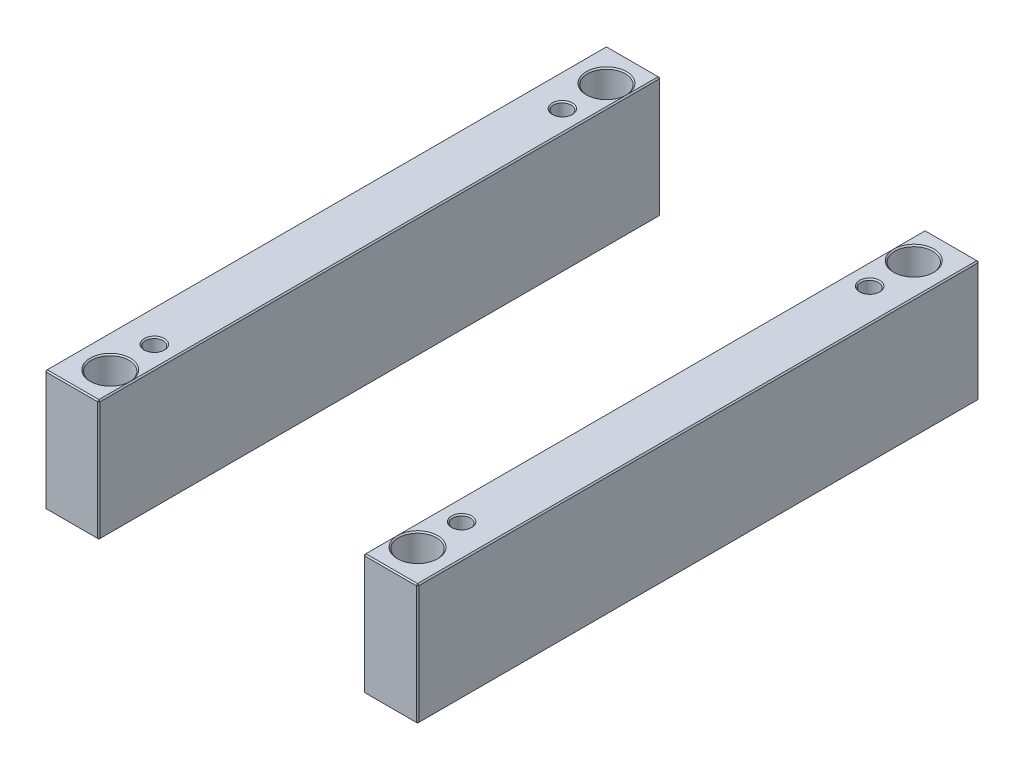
ISO-10303-21;
HEADER;
FILE_DESCRIPTION(('STEP AP214'),'2;1');
FILE_NAME('part.step','',(''),(''),'','','');
FILE_SCHEMA(('AUTOMOTIVE_DESIGN { 1 0 10303 214 1 1 1 1 }'));
ENDSEC;
DATA;
#1=APPLICATION_CONTEXT('core data for automotive mechanical design processes');
#2=APPLICATION_PROTOCOL_DEFINITION('international standard','automotive_design',2000,#1);
#3=PRODUCT_CONTEXT('',#1,'mechanical');
#4=PRODUCT('Part','Part','',(#3));
#5=PRODUCT_RELATED_PRODUCT_CATEGORY('part','',(#4));
#6=PRODUCT_DEFINITION_FORMATION('','',#4);
#7=PRODUCT_DEFINITION_CONTEXT('part definition',#1,'design');
#8=PRODUCT_DEFINITION('design','',#6,#7);
#9=PRODUCT_DEFINITION_SHAPE('','',#8);
#10=(LENGTH_UNIT() NAMED_UNIT(*) SI_UNIT(.MILLI.,.METRE.));
#11=(NAMED_UNIT(*) PLANE_ANGLE_UNIT() SI_UNIT($,.RADIAN.));
#12=(NAMED_UNIT(*) SI_UNIT($,.STERADIAN.) SOLID_ANGLE_UNIT());
#13=UNCERTAINTY_MEASURE_WITH_UNIT(LENGTH_MEASURE(1.E-05),#10,'distance_accuracy_value','');
#14=(GEOMETRIC_REPRESENTATION_CONTEXT(3) GLOBAL_UNCERTAINTY_ASSIGNED_CONTEXT((#13)) GLOBAL_UNIT_ASSIGNED_CONTEXT((#10,
#11,#12)) REPRESENTATION_CONTEXT('',''));
#15=CARTESIAN_POINT('',(0.,0.,0.));
#16=DIRECTION('',(0.,0.,1.));
#17=DIRECTION('',(1.,0.,0.));
#18=AXIS2_PLACEMENT_3D('',#15,#16,#17);
#19=CARTESIAN_POINT('',(-148.,96.,-223.));
#20=DIRECTION('',(0.,0.,1.));
#21=DIRECTION('',(1.,0.,0.));
#22=AXIS2_PLACEMENT_3D('',#19,#20,#21);
#23=PLANE('',#22);
#24=DIRECTION('',(-1.,0.,0.));
#25=VECTOR('',#24,1.);
#26=CARTESIAN_POINT('',(-148.,1.,-223.));
#27=LINE('',#26,#25);
#28=CARTESIAN_POINT('',(-106.,1.,-223.));
#29=VERTEX_POINT('',#28);
#30=CARTESIAN_POINT('',(-147.,1.,-223.));
#31=VERTEX_POINT('',#30);
#32=EDGE_CURVE('P0_E151',#29,#31,#27,.T.);
#33=ORIENTED_EDGE('',*,*,#32,.T.);
#34=DIRECTION('',(0.,1.,0.));
#35=VECTOR('',#34,1.);
#36=CARTESIAN_POINT('',(-147.,96.,-223.));
#37=LINE('',#36,#35);
#38=CARTESIAN_POINT('',(-147.,95.,-223.));
#39=VERTEX_POINT('',#38);
#40=EDGE_CURVE('P0_E266',#31,#39,#37,.T.);
#41=ORIENTED_EDGE('',*,*,#40,.T.);
#42=DIRECTION('',(1.,0.,0.));
#43=VECTOR('',#42,1.);
#44=CARTESIAN_POINT('',(-148.,95.,-223.));
#45=LINE('',#44,#43);
#46=CARTESIAN_POINT('',(-106.,95.,-223.));
#47=VERTEX_POINT('',#46);
#48=EDGE_CURVE('P0_E264',#39,#47,#45,.T.);
#49=ORIENTED_EDGE('',*,*,#48,.T.);
#50=DIRECTION('',(0.,-1.,0.));
#51=VECTOR('',#50,1.);
#52=CARTESIAN_POINT('',(-106.,96.,-223.));
#53=LINE('',#52,#51);
#54=EDGE_CURVE('P0_E261',#47,#29,#53,.T.);
#55=ORIENTED_EDGE('',*,*,#54,.T.);
#56=EDGE_LOOP('',(#33,#41,#49,#55));
#57=FACE_BOUND('',#56,.T.);
#58=ADVANCED_FACE('P0_F16',(#57),#23,.F.);
#59=CARTESIAN_POINT('',(-148.,96.,223.));
#60=DIRECTION('',(1.,0.,0.));
#61=DIRECTION('',(0.,0.,-1.));
#62=AXIS2_PLACEMENT_3D('',#59,#60,#61);
#63=PLANE('',#62);
#64=DIRECTION('',(0.,1.,0.));
#65=VECTOR('',#64,1.);
#66=CARTESIAN_POINT('',(-148.,96.,222.));
#67=LINE('',#66,#65);
#68=CARTESIAN_POINT('',(-148.,1.,222.));
#69=VERTEX_POINT('',#68);
#70=CARTESIAN_POINT('',(-148.,95.,222.));
#71=VERTEX_POINT('',#70);
#72=EDGE_CURVE('P0_E254',#69,#71,#67,.T.);
#73=ORIENTED_EDGE('',*,*,#72,.T.);
#74=DIRECTION('',(0.,0.,-1.));
#75=VECTOR('',#74,1.);
#76=CARTESIAN_POINT('',(-148.,95.,223.));
#77=LINE('',#76,#75);
#78=CARTESIAN_POINT('',(-148.,95.,-222.));
#79=VERTEX_POINT('',#78);
#80=EDGE_CURVE('P0_E259',#71,#79,#77,.T.);
#81=ORIENTED_EDGE('',*,*,#80,.T.);
#82=DIRECTION('',(0.,-1.,0.));
#83=VECTOR('',#82,1.);
#84=CARTESIAN_POINT('',(-148.,96.,-222.));
#85=LINE('',#84,#83);
#86=CARTESIAN_POINT('',(-148.,1.,-222.));
#87=VERTEX_POINT('',#86);
#88=EDGE_CURVE('P0_E256',#79,#87,#85,.T.);
#89=ORIENTED_EDGE('',*,*,#88,.T.);
#90=DIRECTION('',(0.,0.,1.));
#91=VECTOR('',#90,1.);
#92=CARTESIAN_POINT('',(-148.,1.,223.));
#93=LINE('',#92,#91);
#94=EDGE_CURVE('P0_E252',#87,#69,#93,.T.);
#95=ORIENTED_EDGE('',*,*,#94,.T.);
#96=EDGE_LOOP('',(#73,#81,#89,#95));
#97=FACE_BOUND('',#96,.T.);
#98=ADVANCED_FACE('P0_F340',(#97),#63,.F.);
#99=CARTESIAN_POINT('',(-148.,96.,223.));
#100=DIRECTION('',(0.,0.,-1.));
#101=DIRECTION('',(-1.,0.,0.));
#102=AXIS2_PLACEMENT_3D('',#99,#100,#101);
#103=PLANE('',#102);
#104=DIRECTION('',(-1.,0.,0.));
#105=VECTOR('',#104,1.);
#106=CARTESIAN_POINT('',(-148.,95.,223.));
#107=LINE('',#106,#105);
#108=CARTESIAN_POINT('',(-106.,95.,223.));
#109=VERTEX_POINT('',#108);
#110=CARTESIAN_POINT('',(-147.,95.,223.));
#111=VERTEX_POINT('',#110);
#112=EDGE_CURVE('P0_E273',#109,#111,#107,.T.);
#113=ORIENTED_EDGE('',*,*,#112,.T.);
#114=DIRECTION('',(0.,-1.,0.));
#115=VECTOR('',#114,1.);
#116=CARTESIAN_POINT('',(-147.,96.,223.));
#117=LINE('',#116,#115);
#118=CARTESIAN_POINT('',(-147.,1.,223.));
#119=VERTEX_POINT('',#118);
#120=EDGE_CURVE('P0_E275',#111,#119,#117,.T.);
#121=ORIENTED_EDGE('',*,*,#120,.T.);
#122=DIRECTION('',(1.,0.,0.));
#123=VECTOR('',#122,1.);
#124=CARTESIAN_POINT('',(-105.,1.,223.));
#125=LINE('',#124,#123);
#126=CARTESIAN_POINT('',(-106.,1.,223.));
#127=VERTEX_POINT('',#126);
#128=EDGE_CURVE('P0_E271',#119,#127,#125,.T.);
#129=ORIENTED_EDGE('',*,*,#128,.T.);
#130=DIRECTION('',(0.,1.,0.));
#131=VECTOR('',#130,1.);
#132=CARTESIAN_POINT('',(-106.,96.,223.));
#133=LINE('',#132,#131);
#134=EDGE_CURVE('P0_E269',#127,#109,#133,.T.);
#135=ORIENTED_EDGE('',*,*,#134,.T.);
#136=EDGE_LOOP('',(#113,#121,#129,#135));
#137=FACE_BOUND('',#136,.T.);
#138=ADVANCED_FACE('P0_F395',(#137),#103,.F.);
#139=CARTESIAN_POINT('',(-105.,96.,-223.));
#140=DIRECTION('',(-1.,0.,0.));
#141=DIRECTION('',(0.,0.,1.));
#142=AXIS2_PLACEMENT_3D('',#139,#140,#141);
#143=PLANE('',#142);
#144=DIRECTION('',(0.,0.,1.));
#145=VECTOR('',#144,1.);
#146=CARTESIAN_POINT('',(-105.,95.,-223.));
#147=LINE('',#146,#145);
#148=CARTESIAN_POINT('',(-105.,95.,-222.));
#149=VERTEX_POINT('',#148);
#150=CARTESIAN_POINT('',(-105.,95.,222.));
#151=VERTEX_POINT('',#150);
#152=EDGE_CURVE('P0_E294',#149,#151,#147,.T.);
#153=ORIENTED_EDGE('',*,*,#152,.T.);
#154=DIRECTION('',(0.,-1.,0.));
#155=VECTOR('',#154,1.);
#156=CARTESIAN_POINT('',(-105.,96.,222.));
#157=LINE('',#156,#155);
#158=CARTESIAN_POINT('',(-105.,1.,222.));
#159=VERTEX_POINT('',#158);
#160=EDGE_CURVE('P0_E206',#151,#159,#157,.T.);
#161=ORIENTED_EDGE('',*,*,#160,.T.);
#162=DIRECTION('',(0.,0.,-1.));
#163=VECTOR('',#162,1.);
#164=CARTESIAN_POINT('',(-105.,1.,-223.));
#165=LINE('',#164,#163);
#166=CARTESIAN_POINT('',(-105.,1.,-222.));
#167=VERTEX_POINT('',#166);
#168=EDGE_CURVE('P0_E290',#159,#167,#165,.T.);
#169=ORIENTED_EDGE('',*,*,#168,.T.);
#170=DIRECTION('',(0.,1.,0.));
#171=VECTOR('',#170,1.);
#172=CARTESIAN_POINT('',(-105.,96.,-222.));
#173=LINE('',#172,#171);
#174=EDGE_CURVE('P0_E292',#167,#149,#173,.T.);
#175=ORIENTED_EDGE('',*,*,#174,.T.);
#176=EDGE_LOOP('',(#153,#161,#169,#175));
#177=FACE_BOUND('',#176,.T.);
#178=ADVANCED_FACE('P0_F370',(#177),#143,.F.);
#179=CARTESIAN_POINT('',(0.,96.,0.));
#180=DIRECTION('',(0.,-1.,0.));
#181=DIRECTION('',(0.,0.,-1.));
#182=AXIS2_PLACEMENT_3D('',#179,#180,#181);
#183=PLANE('',#182);
#184=CARTESIAN_POINT('',(-122.,96.,162.));
#185=DIRECTION('',(0.,-1.,0.));
#186=DIRECTION('',(0.,0.,-1.));
#187=AXIS2_PLACEMENT_3D('',#184,#185,#186);
#188=CIRCLE('',#187,8.);
#189=CARTESIAN_POINT('',(-122.,96.,154.));
#190=VERTEX_POINT('',#189);
#191=EDGE_CURVE('P0_E209',#190,#190,#188,.T.);
#192=ORIENTED_EDGE('',*,*,#191,.T.);
#193=EDGE_LOOP('',(#192));
#194=FACE_BOUND('',#193,.T.);
#195=CARTESIAN_POINT('',(-122.,96.,-162.));
#196=DIRECTION('',(0.,-1.,0.));
#197=DIRECTION('',(0.,0.,-1.));
#198=AXIS2_PLACEMENT_3D('',#195,#196,#197);
#199=CIRCLE('',#198,8.);
#200=CARTESIAN_POINT('',(-122.,96.,-170.));
#201=VERTEX_POINT('',#200);
#202=EDGE_CURVE('P0_E205',#201,#201,#199,.T.);
#203=ORIENTED_EDGE('',*,*,#202,.T.);
#204=EDGE_LOOP('',(#203));
#205=FACE_BOUND('',#204,.T.);
#206=DIRECTION('',(0.,0.,-1.));
#207=VECTOR('',#206,1.);
#208=CARTESIAN_POINT('',(-106.,96.,0.));
#209=LINE('',#208,#207);
#210=CARTESIAN_POINT('',(-106.,96.,197.));
#211=VERTEX_POINT('',#210);
#212=CARTESIAN_POINT('',(-106.,96.,-197.));
#213=VERTEX_POINT('',#212);
#214=EDGE_CURVE('P0_E283',#211,#213,#209,.T.);
#215=ORIENTED_EDGE('',*,*,#214,.T.);
#216=CARTESIAN_POINT('',(-122.,96.,-197.));
#217=DIRECTION('',(0.,-1.,0.));
#218=DIRECTION('',(0.,0.,-1.));
#219=AXIS2_PLACEMENT_3D('',#216,#217,#218);
#220=CIRCLE('',#219,16.);
#221=EDGE_CURVE('P0_E29',#213,#213,#220,.T.);
#222=ORIENTED_EDGE('',*,*,#221,.T.);
#223=CARTESIAN_POINT('',(-106.,96.,-222.));
#224=VERTEX_POINT('',#223);
#225=EDGE_CURVE('P0_E278',#213,#224,#209,.T.);
#226=ORIENTED_EDGE('',*,*,#225,.T.);
#227=DIRECTION('',(-1.,0.,0.));
#228=VECTOR('',#227,1.);
#229=CARTESIAN_POINT('',(1.43296227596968E-13,96.,-222.));
#230=LINE('',#229,#228);
#231=CARTESIAN_POINT('',(-147.,96.,-222.));
#232=VERTEX_POINT('',#231);
#233=EDGE_CURVE('P0_E282',#224,#232,#230,.T.);
#234=ORIENTED_EDGE('',*,*,#233,.T.);
#235=DIRECTION('',(0.,0.,1.));
#236=VECTOR('',#235,1.);
#237=CARTESIAN_POINT('',(-147.,96.,0.));
#238=LINE('',#237,#236);
#239=CARTESIAN_POINT('',(-147.,96.,222.));
#240=VERTEX_POINT('',#239);
#241=EDGE_CURVE('P0_E285',#232,#240,#238,.T.);
#242=ORIENTED_EDGE('',*,*,#241,.T.);
#243=DIRECTION('',(1.,0.,0.));
#244=VECTOR('',#243,1.);
#245=CARTESIAN_POINT('',(-1.43296227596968E-13,96.,222.));
#246=LINE('',#245,#244);
#247=CARTESIAN_POINT('',(-106.,96.,222.));
#248=VERTEX_POINT('',#247);
#249=EDGE_CURVE('P0_E287',#240,#248,#246,.T.);
#250=ORIENTED_EDGE('',*,*,#249,.T.);
#251=EDGE_CURVE('P0_E279',#248,#211,#209,.T.);
#252=ORIENTED_EDGE('',*,*,#251,.T.);
#253=CARTESIAN_POINT('',(-122.,96.,197.));
#254=DIRECTION('',(0.,-1.,0.));
#255=DIRECTION('',(0.,0.,-1.));
#256=AXIS2_PLACEMENT_3D('',#253,#254,#255);
#257=CIRCLE('',#256,16.);
#258=EDGE_CURVE('P0_E34',#211,#211,#257,.T.);
#259=ORIENTED_EDGE('',*,*,#258,.T.);
#260=EDGE_LOOP('',(#215,#222,#226,#234,#242,#250,#252,#259));
#261=FACE_BOUND('',#260,.T.);
#262=ADVANCED_FACE('P0_F354',(#194,#205,#261),#183,.F.);
#263=CARTESIAN_POINT('',(0.,0.,0.));
#264=DIRECTION('',(0.,-1.,0.));
#265=DIRECTION('',(0.,0.,-1.));
#266=AXIS2_PLACEMENT_3D('',#263,#264,#265);
#267=PLANE('',#266);
#268=CARTESIAN_POINT('',(-122.,0.,-162.));
#269=DIRECTION('',(0.,-1.,0.));
#270=DIRECTION('',(0.,0.,-1.));
#271=AXIS2_PLACEMENT_3D('',#268,#269,#270);
#272=CIRCLE('',#271,8.);
#273=CARTESIAN_POINT('',(-122.,0.,-170.));
#274=VERTEX_POINT('',#273);
#275=EDGE_CURVE('P0_E243',#274,#274,#272,.F.);
#276=ORIENTED_EDGE('',*,*,#275,.T.);
#277=EDGE_LOOP('',(#276));
#278=FACE_BOUND('',#277,.T.);
#279=CARTESIAN_POINT('',(-122.,0.,162.));
#280=DIRECTION('',(0.,-1.,0.));
#281=DIRECTION('',(0.,0.,-1.));
#282=AXIS2_PLACEMENT_3D('',#279,#280,#281);
#283=CIRCLE('',#282,8.);
#284=CARTESIAN_POINT('',(-122.,0.,154.));
#285=VERTEX_POINT('',#284);
#286=EDGE_CURVE('P0_E240',#285,#285,#283,.F.);
#287=ORIENTED_EDGE('',*,*,#286,.T.);
#288=EDGE_LOOP('',(#287));
#289=FACE_BOUND('',#288,.T.);
#290=DIRECTION('',(0.,0.,1.));
#291=VECTOR('',#290,1.);
#292=CARTESIAN_POINT('',(-106.,0.,223.));
#293=LINE('',#292,#291);
#294=CARTESIAN_POINT('',(-106.,0.,-222.));
#295=VERTEX_POINT('',#294);
#296=CARTESIAN_POINT('',(-106.,0.,-197.));
#297=VERTEX_POINT('',#296);
#298=EDGE_CURVE('P0_E120',#295,#297,#293,.T.);
#299=ORIENTED_EDGE('',*,*,#298,.T.);
#300=CARTESIAN_POINT('',(-122.,0.,-197.));
#301=DIRECTION('',(0.,-1.,0.));
#302=DIRECTION('',(0.,0.,-1.));
#303=AXIS2_PLACEMENT_3D('',#300,#301,#302);
#304=CIRCLE('',#303,16.);
#305=EDGE_CURVE('P0_E218',#297,#297,#304,.F.);
#306=ORIENTED_EDGE('',*,*,#305,.T.);
#307=CARTESIAN_POINT('',(-106.,0.,197.));
#308=VERTEX_POINT('',#307);
#309=EDGE_CURVE('P0_E138',#297,#308,#293,.T.);
#310=ORIENTED_EDGE('',*,*,#309,.T.);
#311=CARTESIAN_POINT('',(-122.,0.,197.));
#312=DIRECTION('',(0.,-1.,0.));
#313=DIRECTION('',(0.,0.,-1.));
#314=AXIS2_PLACEMENT_3D('',#311,#312,#313);
#315=CIRCLE('',#314,16.);
#316=EDGE_CURVE('P0_E215',#308,#308,#315,.F.);
#317=ORIENTED_EDGE('',*,*,#316,.T.);
#318=CARTESIAN_POINT('',(-106.,0.,222.));
#319=VERTEX_POINT('',#318);
#320=EDGE_CURVE('P0_E140',#308,#319,#293,.T.);
#321=ORIENTED_EDGE('',*,*,#320,.T.);
#322=DIRECTION('',(-1.,0.,0.));
#323=VECTOR('',#322,1.);
#324=CARTESIAN_POINT('',(-148.,0.,222.));
#325=LINE('',#324,#323);
#326=CARTESIAN_POINT('',(-147.,0.,222.));
#327=VERTEX_POINT('',#326);
#328=EDGE_CURVE('P0_E126',#319,#327,#325,.T.);
#329=ORIENTED_EDGE('',*,*,#328,.T.);
#330=DIRECTION('',(0.,0.,-1.));
#331=VECTOR('',#330,1.);
#332=CARTESIAN_POINT('',(-147.,0.,-223.));
#333=LINE('',#332,#331);
#334=CARTESIAN_POINT('',(-147.,0.,-222.));
#335=VERTEX_POINT('',#334);
#336=EDGE_CURVE('P0_E122',#327,#335,#333,.T.);
#337=ORIENTED_EDGE('',*,*,#336,.T.);
#338=DIRECTION('',(1.,0.,0.));
#339=VECTOR('',#338,1.);
#340=CARTESIAN_POINT('',(-105.,0.,-222.));
#341=LINE('',#340,#339);
#342=EDGE_CURVE('P0_E116',#335,#295,#341,.T.);
#343=ORIENTED_EDGE('',*,*,#342,.T.);
#344=EDGE_LOOP('',(#299,#306,#310,#317,#321,#329,#337,#343));
#345=FACE_BOUND('',#344,.T.);
#346=ADVANCED_FACE('P0_F118',(#278,#289,#345),#267,.T.);
#347=CARTESIAN_POINT('',(-122.,0.,-162.));
#348=DIRECTION('',(0.,1.,0.));
#349=DIRECTION('',(0.,0.,1.));
#350=AXIS2_PLACEMENT_3D('',#347,#348,#349);
#351=CYLINDRICAL_SURFACE('',#350,7.);
#352=CARTESIAN_POINT('',(-122.,95.,-162.));
#353=DIRECTION('',(0.,-1.,0.));
#354=DIRECTION('',(0.,0.,-1.));
#355=AXIS2_PLACEMENT_3D('',#352,#353,#354);
#356=CIRCLE('',#355,7.);
#357=CARTESIAN_POINT('',(-122.,95.,-169.));
#358=VERTEX_POINT('',#357);
#359=EDGE_CURVE('P0_E212',#358,#358,#356,.F.);
#360=ORIENTED_EDGE('',*,*,#359,.T.);
#361=EDGE_LOOP('',(#360));
#362=FACE_BOUND('',#361,.T.);
#363=CARTESIAN_POINT('',(-122.,1.00000000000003,-162.));
#364=DIRECTION('',(0.,-1.,0.));
#365=DIRECTION('',(0.,0.,-1.));
#366=AXIS2_PLACEMENT_3D('',#363,#364,#365);
#367=CIRCLE('',#366,7.);
#368=CARTESIAN_POINT('',(-122.,1.00000000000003,-169.));
#369=VERTEX_POINT('',#368);
#370=EDGE_CURVE('P0_E246',#369,#369,#367,.T.);
#371=ORIENTED_EDGE('',*,*,#370,.T.);
#372=EDGE_LOOP('',(#371));
#373=FACE_BOUND('',#372,.T.);
#374=ADVANCED_FACE('P0_F445',(#362,#373),#351,.F.);
#375=CARTESIAN_POINT('',(-122.,0.,162.));
#376=DIRECTION('',(0.,1.,0.));
#377=DIRECTION('',(0.,0.,1.));
#378=AXIS2_PLACEMENT_3D('',#375,#376,#377);
#379=CYLINDRICAL_SURFACE('',#378,7.);
#380=CARTESIAN_POINT('',(-122.,95.,162.));
#381=DIRECTION('',(0.,-1.,0.));
#382=DIRECTION('',(0.,0.,-1.));
#383=AXIS2_PLACEMENT_3D('',#380,#381,#382);
#384=CIRCLE('',#383,7.);
#385=CARTESIAN_POINT('',(-122.,95.,155.));
#386=VERTEX_POINT('',#385);
#387=EDGE_CURVE('P0_E202',#386,#386,#384,.F.);
#388=ORIENTED_EDGE('',*,*,#387,.T.);
#389=EDGE_LOOP('',(#388));
#390=FACE_BOUND('',#389,.T.);
#391=CARTESIAN_POINT('',(-122.,1.00000000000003,162.));
#392=DIRECTION('',(0.,-1.,0.));
#393=DIRECTION('',(0.,0.,-1.));
#394=AXIS2_PLACEMENT_3D('',#391,#392,#393);
#395=CIRCLE('',#394,7.);
#396=CARTESIAN_POINT('',(-122.,1.00000000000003,155.));
#397=VERTEX_POINT('',#396);
#398=EDGE_CURVE('P0_E249',#397,#397,#395,.T.);
#399=ORIENTED_EDGE('',*,*,#398,.T.);
#400=EDGE_LOOP('',(#399));
#401=FACE_BOUND('',#400,.T.);
#402=ADVANCED_FACE('P0_F403',(#390,#401),#379,.F.);
#403=CARTESIAN_POINT('',(-122.,0.,-162.));
#404=DIRECTION('',(0.,-1.,0.));
#405=DIRECTION('',(0.,0.,-1.));
#406=AXIS2_PLACEMENT_3D('',#403,#404,#405);
#407=CONICAL_SURFACE('',#406,8.,0.785398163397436);
#408=ORIENTED_EDGE('',*,*,#370,.F.);
#409=EDGE_LOOP('',(#408));
#410=FACE_BOUND('',#409,.T.);
#411=ORIENTED_EDGE('',*,*,#275,.F.);
#412=EDGE_LOOP('',(#411));
#413=FACE_BOUND('',#412,.T.);
#414=ADVANCED_FACE('P0_F399',(#410,#413),#407,.F.);
#415=CARTESIAN_POINT('',(-122.,0.,162.));
#416=DIRECTION('',(0.,-1.,0.));
#417=DIRECTION('',(0.,0.,-1.));
#418=AXIS2_PLACEMENT_3D('',#415,#416,#417);
#419=CONICAL_SURFACE('',#418,8.,0.785398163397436);
#420=ORIENTED_EDGE('',*,*,#398,.F.);
#421=EDGE_LOOP('',(#420));
#422=FACE_BOUND('',#421,.T.);
#423=ORIENTED_EDGE('',*,*,#286,.F.);
#424=EDGE_LOOP('',(#423));
#425=FACE_BOUND('',#424,.T.);
#426=ADVANCED_FACE('P0_F402',(#422,#425),#419,.F.);
#427=CARTESIAN_POINT('',(-105.,96.,222.));
#428=DIRECTION('',(-0.707106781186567,0.,-0.707106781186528));
#429=DIRECTION('',(0.,-1.,0.));
#430=AXIS2_PLACEMENT_3D('',#427,#428,#429);
#431=PLANE('',#430);
#432=DIRECTION('',(-0.707106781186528,0.,0.707106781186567));
#433=VECTOR('',#432,1.);
#434=CARTESIAN_POINT('',(-105.5,95.,222.5));
#435=LINE('',#434,#433);
#436=EDGE_CURVE('P0_E199',#109,#151,#435,.F.);
#437=ORIENTED_EDGE('',*,*,#436,.F.);
#438=ORIENTED_EDGE('',*,*,#134,.F.);
#439=DIRECTION('',(0.707106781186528,0.,-0.707106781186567));
#440=VECTOR('',#439,1.);
#441=CARTESIAN_POINT('',(-106.,1.,223.));
#442=LINE('',#441,#440);
#443=EDGE_CURVE('P0_E196',#159,#127,#442,.F.);
#444=ORIENTED_EDGE('',*,*,#443,.F.);
#445=ORIENTED_EDGE('',*,*,#160,.F.);
#446=EDGE_LOOP('',(#437,#438,#444,#445));
#447=FACE_BOUND('',#446,.T.);
#448=ADVANCED_FACE('P0_F367',(#447),#431,.F.);
#449=CARTESIAN_POINT('',(-106.,96.,222.));
#450=DIRECTION('',(0.57735026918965,0.57735026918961,0.577350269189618));
#451=DIRECTION('',(0.707106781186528,0.,-0.707106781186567));
#452=AXIS2_PLACEMENT_3D('',#449,#450,#451);
#453=PLANE('',#452);
#454=DIRECTION('',(0.,0.707106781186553,-0.707106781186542));
#455=VECTOR('',#454,1.);
#456=CARTESIAN_POINT('',(-106.,96.,222.));
#457=LINE('',#456,#455);
#458=EDGE_CURVE('P0_E190',#109,#248,#457,.T.);
#459=ORIENTED_EDGE('',*,*,#458,.F.);
#460=ORIENTED_EDGE('',*,*,#436,.T.);
#461=DIRECTION('',(0.707106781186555,-0.70710678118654,0.));
#462=VECTOR('',#461,1.);
#463=CARTESIAN_POINT('',(-106.,96.,222.));
#464=LINE('',#463,#462);
#465=EDGE_CURVE('P0_E193',#248,#151,#464,.T.);
#466=ORIENTED_EDGE('',*,*,#465,.F.);
#467=EDGE_LOOP('',(#459,#460,#466));
#468=FACE_BOUND('',#467,.T.);
#469=ADVANCED_FACE('P0_F362',(#468),#453,.T.);
#470=CARTESIAN_POINT('',(-106.,1.,223.));
#471=DIRECTION('',(0.57735026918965,-0.57735026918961,0.577350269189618));
#472=DIRECTION('',(0.707106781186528,0.,-0.707106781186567));
#473=AXIS2_PLACEMENT_3D('',#470,#471,#472);
#474=PLANE('',#473);
#475=DIRECTION('',(0.707106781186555,0.70710678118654,0.));
#476=VECTOR('',#475,1.);
#477=CARTESIAN_POINT('',(-105.5,0.499999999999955,222.));
#478=LINE('',#477,#476);
#479=EDGE_CURVE('P0_E185',#159,#319,#478,.F.);
#480=ORIENTED_EDGE('',*,*,#479,.F.);
#481=ORIENTED_EDGE('',*,*,#443,.T.);
#482=DIRECTION('',(0.,-0.707106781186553,-0.707106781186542));
#483=VECTOR('',#482,1.);
#484=CARTESIAN_POINT('',(-106.,1.,223.));
#485=LINE('',#484,#483);
#486=EDGE_CURVE('P0_E187',#319,#127,#485,.F.);
#487=ORIENTED_EDGE('',*,*,#486,.F.);
#488=EDGE_LOOP('',(#480,#481,#487));
#489=FACE_BOUND('',#488,.T.);
#490=ADVANCED_FACE('P0_F492',(#489),#474,.T.);
#491=CARTESIAN_POINT('',(-106.,96.,0.));
#492=DIRECTION('',(-0.70710678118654,-0.707106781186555,0.));
#493=DIRECTION('',(0.,0.,-1.));
#494=AXIS2_PLACEMENT_3D('',#491,#492,#493);
#495=PLANE('',#494);
#496=ORIENTED_EDGE('',*,*,#465,.T.);
#497=ORIENTED_EDGE('',*,*,#152,.F.);
#498=DIRECTION('',(-0.707106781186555,0.70710678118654,0.));
#499=VECTOR('',#498,1.);
#500=CARTESIAN_POINT('',(-105.5,95.5,-222.));
#501=LINE('',#500,#499);
#502=EDGE_CURVE('P0_E179',#224,#149,#501,.F.);
#503=ORIENTED_EDGE('',*,*,#502,.F.);
#504=ORIENTED_EDGE('',*,*,#225,.F.);
#505=ORIENTED_EDGE('',*,*,#214,.F.);
#506=ORIENTED_EDGE('',*,*,#251,.F.);
#507=EDGE_LOOP('',(#496,#497,#503,#504,#505,#506));
#508=FACE_BOUND('',#507,.T.);
#509=ADVANCED_FACE('P0_F358',(#508),#495,.F.);
#510=CARTESIAN_POINT('',(-1.43296227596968E-13,96.,222.));
#511=DIRECTION('',(0.,-0.707106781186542,-0.707106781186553));
#512=DIRECTION('',(1.,0.,0.));
#513=AXIS2_PLACEMENT_3D('',#510,#511,#512);
#514=PLANE('',#513);
#515=ORIENTED_EDGE('',*,*,#458,.T.);
#516=ORIENTED_EDGE('',*,*,#249,.F.);
#517=DIRECTION('',(0.,-0.707106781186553,0.707106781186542));
#518=VECTOR('',#517,1.);
#519=CARTESIAN_POINT('',(-147.,95.5,222.5));
#520=LINE('',#519,#518);
#521=EDGE_CURVE('P0_E176',#111,#240,#520,.F.);
#522=ORIENTED_EDGE('',*,*,#521,.F.);
#523=ORIENTED_EDGE('',*,*,#112,.F.);
#524=EDGE_LOOP('',(#515,#516,#522,#523));
#525=FACE_BOUND('',#524,.T.);
#526=ADVANCED_FACE('P0_F351',(#525),#514,.F.);
#527=CARTESIAN_POINT('',(-147.,96.,223.));
#528=DIRECTION('',(0.707106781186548,0.,-0.707106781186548));
#529=DIRECTION('',(0.,-1.,0.));
#530=AXIS2_PLACEMENT_3D('',#527,#528,#529);
#531=PLANE('',#530);
#532=DIRECTION('',(0.707106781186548,0.,0.707106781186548));
#533=VECTOR('',#532,1.);
#534=CARTESIAN_POINT('',(-147.,1.,223.));
#535=LINE('',#534,#533);
#536=EDGE_CURVE('P0_E170',#119,#69,#535,.F.);
#537=ORIENTED_EDGE('',*,*,#536,.F.);
#538=ORIENTED_EDGE('',*,*,#120,.F.);
#539=DIRECTION('',(-0.707106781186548,0.,-0.707106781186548));
#540=VECTOR('',#539,1.);
#541=CARTESIAN_POINT('',(-148.,95.,222.));
#542=LINE('',#541,#540);
#543=EDGE_CURVE('P0_E173',#71,#111,#542,.F.);
#544=ORIENTED_EDGE('',*,*,#543,.F.);
#545=ORIENTED_EDGE('',*,*,#72,.F.);
#546=EDGE_LOOP('',(#537,#538,#544,#545));
#547=FACE_BOUND('',#546,.T.);
#548=ADVANCED_FACE('P0_F345',(#547),#531,.F.);
#549=CARTESIAN_POINT('',(-148.,1.,223.));
#550=DIRECTION('',(0.,-0.707106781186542,0.707106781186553));
#551=DIRECTION('',(-1.,0.,0.));
#552=AXIS2_PLACEMENT_3D('',#549,#550,#551);
#553=PLANE('',#552);
#554=ORIENTED_EDGE('',*,*,#486,.T.);
#555=ORIENTED_EDGE('',*,*,#128,.F.);
#556=DIRECTION('',(0.,0.707106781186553,0.707106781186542));
#557=VECTOR('',#556,1.);
#558=CARTESIAN_POINT('',(-147.,1.,223.));
#559=LINE('',#558,#557);
#560=EDGE_CURVE('P0_E148',#327,#119,#559,.T.);
#561=ORIENTED_EDGE('',*,*,#560,.F.);
#562=ORIENTED_EDGE('',*,*,#328,.F.);
#563=EDGE_LOOP('',(#554,#555,#561,#562));
#564=FACE_BOUND('',#563,.T.);
#565=ADVANCED_FACE('P0_F434',(#564),#553,.T.);
#566=CARTESIAN_POINT('',(-105.,1.,-223.));
#567=DIRECTION('',(0.70710678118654,-0.707106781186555,0.));
#568=DIRECTION('',(0.,0.,1.));
#569=AXIS2_PLACEMENT_3D('',#566,#567,#568);
#570=PLANE('',#569);
#571=ORIENTED_EDGE('',*,*,#479,.T.);
#572=ORIENTED_EDGE('',*,*,#320,.F.);
#573=ORIENTED_EDGE('',*,*,#309,.F.);
#574=ORIENTED_EDGE('',*,*,#298,.F.);
#575=DIRECTION('',(-0.707106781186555,-0.70710678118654,0.));
#576=VECTOR('',#575,1.);
#577=CARTESIAN_POINT('',(-106.,0.,-222.));
#578=LINE('',#577,#576);
#579=EDGE_CURVE('P0_E134',#167,#295,#578,.T.);
#580=ORIENTED_EDGE('',*,*,#579,.F.);
#581=ORIENTED_EDGE('',*,*,#168,.F.);
#582=EDGE_LOOP('',(#571,#572,#573,#574,#580,#581));
#583=FACE_BOUND('',#582,.T.);
#584=ADVANCED_FACE('P0_F133',(#583),#570,.T.);
#585=CARTESIAN_POINT('',(-106.,96.,-223.));
#586=DIRECTION('',(-0.707106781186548,0.,0.707106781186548));
#587=DIRECTION('',(0.,-1.,0.));
#588=AXIS2_PLACEMENT_3D('',#585,#586,#587);
#589=PLANE('',#588);
#590=DIRECTION('',(0.707106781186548,0.,0.707106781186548));
#591=VECTOR('',#590,1.);
#592=CARTESIAN_POINT('',(-106.,95.,-223.));
#593=LINE('',#592,#591);
#594=EDGE_CURVE('P0_E182',#149,#47,#593,.F.);
#595=ORIENTED_EDGE('',*,*,#594,.F.);
#596=ORIENTED_EDGE('',*,*,#174,.F.);
#597=DIRECTION('',(-0.707106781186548,0.,-0.707106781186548));
#598=VECTOR('',#597,1.);
#599=CARTESIAN_POINT('',(-105.5,1.,-222.5));
#600=LINE('',#599,#598);
#601=EDGE_CURVE('P0_E147',#29,#167,#600,.F.);
#602=ORIENTED_EDGE('',*,*,#601,.F.);
#603=ORIENTED_EDGE('',*,*,#54,.F.);
#604=EDGE_LOOP('',(#595,#596,#602,#603));
#605=FACE_BOUND('',#604,.T.);
#606=ADVANCED_FACE('P0_F375',(#605),#589,.F.);
#607=CARTESIAN_POINT('',(-106.,95.,-223.));
#608=DIRECTION('',(0.577350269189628,0.57735026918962,-0.577350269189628));
#609=DIRECTION('',(-0.707106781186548,0.,-0.707106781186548));
#610=AXIS2_PLACEMENT_3D('',#607,#608,#609);
#611=PLANE('',#610);
#612=ORIENTED_EDGE('',*,*,#502,.T.);
#613=ORIENTED_EDGE('',*,*,#594,.T.);
#614=DIRECTION('',(0.,-0.707106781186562,-0.707106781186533));
#615=VECTOR('',#614,1.);
#616=CARTESIAN_POINT('',(-106.,95.,-223.));
#617=LINE('',#616,#615);
#618=EDGE_CURVE('P0_E165',#224,#47,#617,.T.);
#619=ORIENTED_EDGE('',*,*,#618,.F.);
#620=EDGE_LOOP('',(#612,#613,#619));
#621=FACE_BOUND('',#620,.T.);
#622=ADVANCED_FACE('P0_F377',(#621),#611,.T.);
#623=CARTESIAN_POINT('',(-148.,95.,222.));
#624=DIRECTION('',(-0.577350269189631,0.577350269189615,0.577350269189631));
#625=DIRECTION('',(0.707106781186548,0.,0.707106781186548));
#626=AXIS2_PLACEMENT_3D('',#623,#624,#625);
#627=PLANE('',#626);
#628=ORIENTED_EDGE('',*,*,#543,.T.);
#629=ORIENTED_EDGE('',*,*,#521,.T.);
#630=DIRECTION('',(0.707106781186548,0.707106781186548,0.));
#631=VECTOR('',#630,1.);
#632=CARTESIAN_POINT('',(-148.,95.,222.));
#633=LINE('',#632,#631);
#634=EDGE_CURVE('P0_E156',#71,#240,#633,.T.);
#635=ORIENTED_EDGE('',*,*,#634,.F.);
#636=EDGE_LOOP('',(#628,#629,#635));
#637=FACE_BOUND('',#636,.T.);
#638=ADVANCED_FACE('P0_F348',(#637),#627,.T.);
#639=CARTESIAN_POINT('',(-147.,1.,223.));
#640=DIRECTION('',(-0.577350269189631,-0.577350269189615,0.577350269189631));
#641=DIRECTION('',(0.707106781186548,0.,0.707106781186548));
#642=AXIS2_PLACEMENT_3D('',#639,#640,#641);
#643=PLANE('',#642);
#644=ORIENTED_EDGE('',*,*,#560,.T.);
#645=ORIENTED_EDGE('',*,*,#536,.T.);
#646=DIRECTION('',(0.707106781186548,-0.707106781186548,0.));
#647=VECTOR('',#646,1.);
#648=CARTESIAN_POINT('',(-147.5,0.499999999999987,222.));
#649=LINE('',#648,#647);
#650=EDGE_CURVE('P0_E152',#327,#69,#649,.F.);
#651=ORIENTED_EDGE('',*,*,#650,.F.);
#652=EDGE_LOOP('',(#644,#645,#651));
#653=FACE_BOUND('',#652,.T.);
#654=ADVANCED_FACE('P0_F386',(#653),#643,.T.);
#655=CARTESIAN_POINT('',(-106.,0.,-222.));
#656=DIRECTION('',(0.577350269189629,-0.57735026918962,-0.577350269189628));
#657=DIRECTION('',(-0.707106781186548,0.,-0.707106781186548));
#658=AXIS2_PLACEMENT_3D('',#655,#656,#657);
#659=PLANE('',#658);
#660=ORIENTED_EDGE('',*,*,#601,.T.);
#661=ORIENTED_EDGE('',*,*,#579,.T.);
#662=DIRECTION('',(0.,0.707106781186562,-0.707106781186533));
#663=VECTOR('',#662,1.);
#664=CARTESIAN_POINT('',(-106.,0.,-222.));
#665=LINE('',#664,#663);
#666=EDGE_CURVE('P0_E144',#29,#295,#665,.F.);
#667=ORIENTED_EDGE('',*,*,#666,.F.);
#668=EDGE_LOOP('',(#660,#661,#667));
#669=FACE_BOUND('',#668,.T.);
#670=ADVANCED_FACE('P0_F143',(#669),#659,.T.);
#671=CARTESIAN_POINT('',(1.43296227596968E-13,96.,-222.));
#672=DIRECTION('',(0.,-0.707106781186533,0.707106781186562));
#673=DIRECTION('',(-1.,0.,0.));
#674=AXIS2_PLACEMENT_3D('',#671,#672,#673);
#675=PLANE('',#674);
#676=ORIENTED_EDGE('',*,*,#618,.T.);
#677=ORIENTED_EDGE('',*,*,#48,.F.);
#678=DIRECTION('',(0.,0.707106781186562,0.707106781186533));
#679=VECTOR('',#678,1.);
#680=CARTESIAN_POINT('',(-147.,95.,-223.));
#681=LINE('',#680,#679);
#682=EDGE_CURVE('P0_E153',#232,#39,#681,.F.);
#683=ORIENTED_EDGE('',*,*,#682,.F.);
#684=ORIENTED_EDGE('',*,*,#233,.F.);
#685=EDGE_LOOP('',(#676,#677,#683,#684));
#686=FACE_BOUND('',#685,.T.);
#687=ADVANCED_FACE('P0_F323',(#686),#675,.F.);
#688=CARTESIAN_POINT('',(-147.,96.,0.));
#689=DIRECTION('',(0.707106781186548,-0.707106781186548,0.));
#690=DIRECTION('',(0.,0.,1.));
#691=AXIS2_PLACEMENT_3D('',#688,#689,#690);
#692=PLANE('',#691);
#693=ORIENTED_EDGE('',*,*,#634,.T.);
#694=ORIENTED_EDGE('',*,*,#241,.F.);
#695=DIRECTION('',(-0.707106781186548,-0.707106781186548,0.));
#696=VECTOR('',#695,1.);
#697=CARTESIAN_POINT('',(-147.5,95.5,-222.));
#698=LINE('',#697,#696);
#699=EDGE_CURVE('P0_E159',#79,#232,#698,.F.);
#700=ORIENTED_EDGE('',*,*,#699,.F.);
#701=ORIENTED_EDGE('',*,*,#80,.F.);
#702=EDGE_LOOP('',(#693,#694,#700,#701));
#703=FACE_BOUND('',#702,.T.);
#704=ADVANCED_FACE('P0_F317',(#703),#692,.F.);
#705=CARTESIAN_POINT('',(-148.,1.,223.));
#706=DIRECTION('',(-0.707106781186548,-0.707106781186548,0.));
#707=DIRECTION('',(0.,0.,-1.));
#708=AXIS2_PLACEMENT_3D('',#705,#706,#707);
#709=PLANE('',#708);
#710=ORIENTED_EDGE('',*,*,#650,.T.);
#711=ORIENTED_EDGE('',*,*,#94,.F.);
#712=DIRECTION('',(-0.707106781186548,0.707106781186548,0.));
#713=VECTOR('',#712,1.);
#714=CARTESIAN_POINT('',(-148.,1.,-222.));
#715=LINE('',#714,#713);
#716=EDGE_CURVE('P0_E304',#335,#87,#715,.T.);
#717=ORIENTED_EDGE('',*,*,#716,.F.);
#718=ORIENTED_EDGE('',*,*,#336,.F.);
#719=EDGE_LOOP('',(#710,#711,#717,#718));
#720=FACE_BOUND('',#719,.T.);
#721=ADVANCED_FACE('P0_F336',(#720),#709,.T.);
#722=CARTESIAN_POINT('',(-148.,1.,-223.));
#723=DIRECTION('',(0.,-0.707106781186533,-0.707106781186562));
#724=DIRECTION('',(1.,0.,0.));
#725=AXIS2_PLACEMENT_3D('',#722,#723,#724);
#726=PLANE('',#725);
#727=ORIENTED_EDGE('',*,*,#666,.T.);
#728=ORIENTED_EDGE('',*,*,#342,.F.);
#729=DIRECTION('',(0.,-0.707106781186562,0.707106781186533));
#730=VECTOR('',#729,1.);
#731=CARTESIAN_POINT('',(-147.,0.500000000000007,-222.5));
#732=LINE('',#731,#730);
#733=EDGE_CURVE('P0_E302',#31,#335,#732,.T.);
#734=ORIENTED_EDGE('',*,*,#733,.F.);
#735=ORIENTED_EDGE('',*,*,#32,.F.);
#736=EDGE_LOOP('',(#727,#728,#734,#735));
#737=FACE_BOUND('',#736,.T.);
#738=ADVANCED_FACE('P0_F150',(#737),#726,.T.);
#739=CARTESIAN_POINT('',(-147.,95.,-223.));
#740=DIRECTION('',(-0.577350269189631,0.577350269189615,-0.577350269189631));
#741=DIRECTION('',(-0.707106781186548,0.,0.707106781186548));
#742=AXIS2_PLACEMENT_3D('',#739,#740,#741);
#743=PLANE('',#742);
#744=ORIENTED_EDGE('',*,*,#699,.T.);
#745=ORIENTED_EDGE('',*,*,#682,.T.);
#746=DIRECTION('',(0.707106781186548,0.,-0.707106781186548));
#747=VECTOR('',#746,1.);
#748=CARTESIAN_POINT('',(-147.,95.,-223.));
#749=LINE('',#748,#747);
#750=EDGE_CURVE('P0_E300',#79,#39,#749,.T.);
#751=ORIENTED_EDGE('',*,*,#750,.F.);
#752=EDGE_LOOP('',(#744,#745,#751));
#753=FACE_BOUND('',#752,.T.);
#754=ADVANCED_FACE('P0_F310',(#753),#743,.T.);
#755=CARTESIAN_POINT('',(-148.,1.,-222.));
#756=DIRECTION('',(-0.577350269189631,-0.577350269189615,-0.577350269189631));
#757=DIRECTION('',(-0.707106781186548,0.,0.707106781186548));
#758=AXIS2_PLACEMENT_3D('',#755,#756,#757);
#759=PLANE('',#758);
#760=ORIENTED_EDGE('',*,*,#733,.T.);
#761=ORIENTED_EDGE('',*,*,#716,.T.);
#762=DIRECTION('',(-0.707106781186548,0.,0.707106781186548));
#763=VECTOR('',#762,1.);
#764=CARTESIAN_POINT('',(-148.,1.,-222.));
#765=LINE('',#764,#763);
#766=EDGE_CURVE('P0_E298',#31,#87,#765,.T.);
#767=ORIENTED_EDGE('',*,*,#766,.F.);
#768=EDGE_LOOP('',(#760,#761,#767));
#769=FACE_BOUND('',#768,.T.);
#770=ADVANCED_FACE('P0_F332',(#769),#759,.T.);
#771=CARTESIAN_POINT('',(-148.,96.,-222.));
#772=DIRECTION('',(0.707106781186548,0.,0.707106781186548));
#773=DIRECTION('',(0.,-1.,0.));
#774=AXIS2_PLACEMENT_3D('',#771,#772,#773);
#775=PLANE('',#774);
#776=ORIENTED_EDGE('',*,*,#750,.T.);
#777=ORIENTED_EDGE('',*,*,#40,.F.);
#778=ORIENTED_EDGE('',*,*,#766,.T.);
#779=ORIENTED_EDGE('',*,*,#88,.F.);
#780=EDGE_LOOP('',(#776,#777,#778,#779));
#781=FACE_BOUND('',#780,.T.);
#782=ADVANCED_FACE('P0_F330',(#781),#775,.F.);
#783=CARTESIAN_POINT('',(-122.,95.,162.));
#784=DIRECTION('',(0.,1.,0.));
#785=DIRECTION('',(0.,0.,1.));
#786=AXIS2_PLACEMENT_3D('',#783,#784,#785);
#787=CONICAL_SURFACE('',#786,7.,0.785398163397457);
#788=ORIENTED_EDGE('',*,*,#191,.F.);
#789=EDGE_LOOP('',(#788));
#790=FACE_BOUND('',#789,.T.);
#791=ORIENTED_EDGE('',*,*,#387,.F.);
#792=EDGE_LOOP('',(#791));
#793=FACE_BOUND('',#792,.T.);
#794=ADVANCED_FACE('P0_F410',(#790,#793),#787,.F.);
#795=CARTESIAN_POINT('',(-122.,95.,-162.));
#796=DIRECTION('',(0.,1.,0.));
#797=DIRECTION('',(0.,0.,1.));
#798=AXIS2_PLACEMENT_3D('',#795,#796,#797);
#799=CONICAL_SURFACE('',#798,7.,0.785398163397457);
#800=ORIENTED_EDGE('',*,*,#202,.F.);
#801=EDGE_LOOP('',(#800));
#802=FACE_BOUND('',#801,.T.);
#803=ORIENTED_EDGE('',*,*,#359,.F.);
#804=EDGE_LOOP('',(#803));
#805=FACE_BOUND('',#804,.T.);
#806=ADVANCED_FACE('P0_F459',(#802,#805),#799,.F.);
#807=CARTESIAN_POINT('',(-122.,0.,197.));
#808=DIRECTION('',(0.,1.,0.));
#809=DIRECTION('',(0.,0.,1.));
#810=AXIS2_PLACEMENT_3D('',#807,#808,#809);
#811=CYLINDRICAL_SURFACE('',#810,15.);
#812=CARTESIAN_POINT('',(-122.,95.,197.));
#813=DIRECTION('',(0.,-1.,0.));
#814=DIRECTION('',(0.,0.,-1.));
#815=AXIS2_PLACEMENT_3D('',#812,#813,#814);
#816=CIRCLE('',#815,15.);
#817=CARTESIAN_POINT('',(-122.,95.,182.));
#818=VERTEX_POINT('',#817);
#819=EDGE_CURVE('P0_E10',#818,#818,#816,.F.);
#820=ORIENTED_EDGE('',*,*,#819,.T.);
#821=EDGE_LOOP('',(#820));
#822=FACE_BOUND('',#821,.T.);
#823=CARTESIAN_POINT('',(-122.,0.999999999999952,197.));
#824=DIRECTION('',(0.,-1.,0.));
#825=DIRECTION('',(0.,0.,-1.));
#826=AXIS2_PLACEMENT_3D('',#823,#824,#825);
#827=CIRCLE('',#826,15.);
#828=CARTESIAN_POINT('',(-122.,0.999999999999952,182.));
#829=VERTEX_POINT('',#828);
#830=EDGE_CURVE('P0_E24',#829,#829,#827,.T.);
#831=ORIENTED_EDGE('',*,*,#830,.T.);
#832=EDGE_LOOP('',(#831));
#833=FACE_BOUND('',#832,.T.);
#834=ADVANCED_FACE('P0_F230',(#822,#833),#811,.F.);
#835=CARTESIAN_POINT('',(-122.,0.,-197.));
#836=DIRECTION('',(0.,1.,0.));
#837=DIRECTION('',(0.,0.,1.));
#838=AXIS2_PLACEMENT_3D('',#835,#836,#837);
#839=CYLINDRICAL_SURFACE('',#838,15.);
#840=CARTESIAN_POINT('',(-122.,1.00000000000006,-197.));
#841=DIRECTION('',(0.,-1.,0.));
#842=DIRECTION('',(0.,0.,-1.));
#843=AXIS2_PLACEMENT_3D('',#840,#841,#842);
#844=CIRCLE('',#843,15.);
#845=CARTESIAN_POINT('',(-122.,1.00000000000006,-212.));
#846=VERTEX_POINT('',#845);
#847=EDGE_CURVE('P0_E223',#846,#846,#844,.T.);
#848=ORIENTED_EDGE('',*,*,#847,.T.);
#849=EDGE_LOOP('',(#848));
#850=FACE_BOUND('',#849,.T.);
#851=CARTESIAN_POINT('',(-122.,95.,-197.));
#852=DIRECTION('',(0.,-1.,0.));
#853=DIRECTION('',(0.,0.,-1.));
#854=AXIS2_PLACEMENT_3D('',#851,#852,#853);
#855=CIRCLE('',#854,15.);
#856=CARTESIAN_POINT('',(-122.,95.,-212.));
#857=VERTEX_POINT('',#856);
#858=EDGE_CURVE('P0_E220',#857,#857,#855,.F.);
#859=ORIENTED_EDGE('',*,*,#858,.T.);
#860=EDGE_LOOP('',(#859));
#861=FACE_BOUND('',#860,.T.);
#862=ADVANCED_FACE('P0_F458',(#850,#861),#839,.F.);
#863=CARTESIAN_POINT('',(-122.,0.,-197.));
#864=DIRECTION('',(0.,-1.,0.));
#865=DIRECTION('',(0.,0.,-1.));
#866=AXIS2_PLACEMENT_3D('',#863,#864,#865);
#867=CONICAL_SURFACE('',#866,16.,0.785398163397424);
#868=ORIENTED_EDGE('',*,*,#847,.F.);
#869=EDGE_LOOP('',(#868));
#870=FACE_BOUND('',#869,.T.);
#871=ORIENTED_EDGE('',*,*,#305,.F.);
#872=EDGE_LOOP('',(#871));
#873=FACE_BOUND('',#872,.T.);
#874=ADVANCED_FACE('P0_F462',(#870,#873),#867,.F.);
#875=CARTESIAN_POINT('',(-122.,95.,-197.));
#876=DIRECTION('',(0.,1.,0.));
#877=DIRECTION('',(0.,0.,1.));
#878=AXIS2_PLACEMENT_3D('',#875,#876,#877);
#879=CONICAL_SURFACE('',#878,15.,0.785398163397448);
#880=ORIENTED_EDGE('',*,*,#221,.F.);
#881=EDGE_LOOP('',(#880));
#882=FACE_BOUND('',#881,.T.);
#883=ORIENTED_EDGE('',*,*,#858,.F.);
#884=EDGE_LOOP('',(#883));
#885=FACE_BOUND('',#884,.T.);
#886=ADVANCED_FACE('P0_F468',(#882,#885),#879,.F.);
#887=CARTESIAN_POINT('',(-122.,95.,197.));
#888=DIRECTION('',(0.,1.,0.));
#889=DIRECTION('',(0.,0.,1.));
#890=AXIS2_PLACEMENT_3D('',#887,#888,#889);
#891=CONICAL_SURFACE('',#890,15.,0.785398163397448);
#892=ORIENTED_EDGE('',*,*,#258,.F.);
#893=EDGE_LOOP('',(#892));
#894=FACE_BOUND('',#893,.T.);
#895=ORIENTED_EDGE('',*,*,#819,.F.);
#896=EDGE_LOOP('',(#895));
#897=FACE_BOUND('',#896,.T.);
#898=ADVANCED_FACE('P0_F234',(#894,#897),#891,.F.);
#899=CARTESIAN_POINT('',(-122.,0.,197.));
#900=DIRECTION('',(0.,-1.,0.));
#901=DIRECTION('',(0.,0.,-1.));
#902=AXIS2_PLACEMENT_3D('',#899,#900,#901);
#903=CONICAL_SURFACE('',#902,16.,0.78539816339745);
#904=ORIENTED_EDGE('',*,*,#830,.F.);
#905=EDGE_LOOP('',(#904));
#906=FACE_BOUND('',#905,.T.);
#907=ORIENTED_EDGE('',*,*,#316,.F.);
#908=EDGE_LOOP('',(#907));
#909=FACE_BOUND('',#908,.T.);
#910=ADVANCED_FACE('P0_F18',(#906,#909),#903,.F.);
#911=CLOSED_SHELL('',(#58,#98,#138,#178,#262,#346,#374,#402,#414,#426,#448,#469,#490,#509,#526,
#548,#565,#584,#606,#622,#638,#654,#670,#687,#704,#721,#738,#754,#770,#782,#794,#806,#834,#862,
#874,#886,#898,#910));
#912=MANIFOLD_SOLID_BREP('P0_B1',#911);
#913=CARTESIAN_POINT('',(148.,96.,223.));
#914=DIRECTION('',(0.,0.,-1.));
#915=DIRECTION('',(-1.,0.,0.));
#916=AXIS2_PLACEMENT_3D('',#913,#914,#915);
#917=PLANE('',#916);
#918=DIRECTION('',(0.,-1.,0.));
#919=VECTOR('',#918,1.);
#920=CARTESIAN_POINT('',(106.,96.,223.));
#921=LINE('',#920,#919);
#922=CARTESIAN_POINT('',(106.,95.,223.));
#923=VERTEX_POINT('',#922);
#924=CARTESIAN_POINT('',(106.,0.999999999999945,223.));
#925=VERTEX_POINT('',#924);
#926=EDGE_CURVE('P1_E189',#923,#925,#921,.T.);
#927=ORIENTED_EDGE('',*,*,#926,.T.);
#928=DIRECTION('',(1.,0.,0.));
#929=VECTOR('',#928,1.);
#930=CARTESIAN_POINT('',(148.,0.999999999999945,223.));
#931=LINE('',#930,#929);
#932=CARTESIAN_POINT('',(147.,0.999999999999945,223.));
#933=VERTEX_POINT('',#932);
#934=EDGE_CURVE('P1_E191',#925,#933,#931,.T.);
#935=ORIENTED_EDGE('',*,*,#934,.T.);
#936=DIRECTION('',(0.,1.,0.));
#937=VECTOR('',#936,1.);
#938=CARTESIAN_POINT('',(147.,96.,223.));
#939=LINE('',#938,#937);
#940=CARTESIAN_POINT('',(147.,95.,223.));
#941=VERTEX_POINT('',#940);
#942=EDGE_CURVE('P1_E187',#933,#941,#939,.T.);
#943=ORIENTED_EDGE('',*,*,#942,.T.);
#944=DIRECTION('',(-1.,0.,0.));
#945=VECTOR('',#944,1.);
#946=CARTESIAN_POINT('',(105.,95.,223.));
#947=LINE('',#946,#945);
#948=EDGE_CURVE('P1_E185',#941,#923,#947,.T.);
#949=ORIENTED_EDGE('',*,*,#948,.T.);
#950=EDGE_LOOP('',(#927,#935,#943,#949));
#951=FACE_BOUND('',#950,.T.);
#952=ADVANCED_FACE('P1_F17',(#951),#917,.F.);
#953=CARTESIAN_POINT('',(148.,96.,223.));
#954=DIRECTION('',(-1.,0.,0.));
#955=DIRECTION('',(0.,0.,1.));
#956=AXIS2_PLACEMENT_3D('',#953,#954,#955);
#957=PLANE('',#956);
#958=DIRECTION('',(0.,0.,1.));
#959=VECTOR('',#958,1.);
#960=CARTESIAN_POINT('',(148.,95.,223.));
#961=LINE('',#960,#959);
#962=CARTESIAN_POINT('',(148.,95.,-222.));
#963=VERTEX_POINT('',#962);
#964=CARTESIAN_POINT('',(148.,95.,222.));
#965=VERTEX_POINT('',#964);
#966=EDGE_CURVE('P1_E203',#963,#965,#961,.T.);
#967=ORIENTED_EDGE('',*,*,#966,.T.);
#968=DIRECTION('',(0.,-1.,0.));
#969=VECTOR('',#968,1.);
#970=CARTESIAN_POINT('',(148.,96.,222.));
#971=LINE('',#970,#969);
#972=CARTESIAN_POINT('',(148.,0.999999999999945,222.));
#973=VERTEX_POINT('',#972);
#974=EDGE_CURVE('P1_E209',#965,#973,#971,.T.);
#975=ORIENTED_EDGE('',*,*,#974,.T.);
#976=DIRECTION('',(0.,0.,-1.));
#977=VECTOR('',#976,1.);
#978=CARTESIAN_POINT('',(148.,0.999999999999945,223.));
#979=LINE('',#978,#977);
#980=CARTESIAN_POINT('',(148.,0.999999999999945,-222.));
#981=VERTEX_POINT('',#980);
#982=EDGE_CURVE('P1_E207',#973,#981,#979,.T.);
#983=ORIENTED_EDGE('',*,*,#982,.T.);
#984=DIRECTION('',(0.,1.,0.));
#985=VECTOR('',#984,1.);
#986=CARTESIAN_POINT('',(148.,96.,-222.));
#987=LINE('',#986,#985);
#988=EDGE_CURVE('P1_E205',#981,#963,#987,.T.);
#989=ORIENTED_EDGE('',*,*,#988,.T.);
#990=EDGE_LOOP('',(#967,#975,#983,#989));
#991=FACE_BOUND('',#990,.T.);
#992=ADVANCED_FACE('P1_F312',(#991),#957,.F.);
#993=CARTESIAN_POINT('',(148.,96.,-223.));
#994=DIRECTION('',(0.,0.,1.));
#995=DIRECTION('',(1.,0.,0.));
#996=AXIS2_PLACEMENT_3D('',#993,#994,#995);
#997=PLANE('',#996);
#998=DIRECTION('',(0.,-1.,0.));
#999=VECTOR('',#998,1.);
#1000=CARTESIAN_POINT('',(147.,96.,-223.));
#1001=LINE('',#1000,#999);
#1002=CARTESIAN_POINT('',(147.,95.,-223.));
#1003=VERTEX_POINT('',#1002);
#1004=CARTESIAN_POINT('',(147.,0.999999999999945,-223.));
#1005=VERTEX_POINT('',#1004);
#1006=EDGE_CURVE('P1_E180',#1003,#1005,#1001,.T.);
#1007=ORIENTED_EDGE('',*,*,#1006,.T.);
#1008=DIRECTION('',(-1.,0.,0.));
#1009=VECTOR('',#1008,1.);
#1010=CARTESIAN_POINT('',(148.,0.999999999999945,-223.));
#1011=LINE('',#1010,#1009);
#1012=CARTESIAN_POINT('',(106.,0.999999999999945,-223.));
#1013=VERTEX_POINT('',#1012);
#1014=EDGE_CURVE('P1_E124',#1005,#1013,#1011,.T.);
#1015=ORIENTED_EDGE('',*,*,#1014,.T.);
#1016=DIRECTION('',(0.,1.,0.));
#1017=VECTOR('',#1016,1.);
#1018=CARTESIAN_POINT('',(106.,96.,-223.));
#1019=LINE('',#1018,#1017);
#1020=CARTESIAN_POINT('',(106.,95.,-223.));
#1021=VERTEX_POINT('',#1020);
#1022=EDGE_CURVE('P1_E182',#1013,#1021,#1019,.T.);
#1023=ORIENTED_EDGE('',*,*,#1022,.T.);
#1024=DIRECTION('',(1.,0.,0.));
#1025=VECTOR('',#1024,1.);
#1026=CARTESIAN_POINT('',(148.,95.,-223.));
#1027=LINE('',#1026,#1025);
#1028=EDGE_CURVE('P1_E178',#1021,#1003,#1027,.T.);
#1029=ORIENTED_EDGE('',*,*,#1028,.T.);
#1030=EDGE_LOOP('',(#1007,#1015,#1023,#1029));
#1031=FACE_BOUND('',#1030,.T.);
#1032=ADVANCED_FACE('P1_F319',(#1031),#997,.F.);
#1033=CARTESIAN_POINT('',(105.,96.,-223.));
#1034=DIRECTION('',(1.,0.,0.));
#1035=DIRECTION('',(0.,0.,-1.));
#1036=AXIS2_PLACEMENT_3D('',#1033,#1034,#1035);
#1037=PLANE('',#1036);
#1038=DIRECTION('',(0.,0.,-1.));
#1039=VECTOR('',#1038,1.);
#1040=CARTESIAN_POINT('',(105.,95.,-223.));
#1041=LINE('',#1040,#1039);
#1042=CARTESIAN_POINT('',(105.,95.,222.));
#1043=VERTEX_POINT('',#1042);
#1044=CARTESIAN_POINT('',(105.,95.,-222.));
#1045=VERTEX_POINT('',#1044);
#1046=EDGE_CURVE('P1_E194',#1043,#1045,#1041,.T.);
#1047=ORIENTED_EDGE('',*,*,#1046,.T.);
#1048=DIRECTION('',(0.,-1.,0.));
#1049=VECTOR('',#1048,1.);
#1050=CARTESIAN_POINT('',(105.,96.,-222.));
#1051=LINE('',#1050,#1049);
#1052=CARTESIAN_POINT('',(105.,0.999999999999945,-222.));
#1053=VERTEX_POINT('',#1052);
#1054=EDGE_CURVE('P1_E200',#1045,#1053,#1051,.T.);
#1055=ORIENTED_EDGE('',*,*,#1054,.T.);
#1056=DIRECTION('',(0.,0.,1.));
#1057=VECTOR('',#1056,1.);
#1058=CARTESIAN_POINT('',(105.,0.999999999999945,-223.));
#1059=LINE('',#1058,#1057);
#1060=CARTESIAN_POINT('',(105.,0.999999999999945,222.));
#1061=VERTEX_POINT('',#1060);
#1062=EDGE_CURVE('P1_E198',#1053,#1061,#1059,.T.);
#1063=ORIENTED_EDGE('',*,*,#1062,.T.);
#1064=DIRECTION('',(0.,1.,0.));
#1065=VECTOR('',#1064,1.);
#1066=CARTESIAN_POINT('',(105.,96.,222.));
#1067=LINE('',#1066,#1065);
#1068=EDGE_CURVE('P1_E196',#1061,#1043,#1067,.T.);
#1069=ORIENTED_EDGE('',*,*,#1068,.T.);
#1070=EDGE_LOOP('',(#1047,#1055,#1063,#1069));
#1071=FACE_BOUND('',#1070,.T.);
#1072=ADVANCED_FACE('P1_F447',(#1071),#1037,.F.);
#1073=CARTESIAN_POINT('',(0.,96.,0.));
#1074=DIRECTION('',(0.,1.,0.));
#1075=DIRECTION('',(0.,0.,1.));
#1076=AXIS2_PLACEMENT_3D('',#1073,#1074,#1075);
#1077=PLANE('',#1076);
#1078=DIRECTION('',(0.,0.,1.));
#1079=VECTOR('',#1078,1.);
#1080=CARTESIAN_POINT('',(106.,96.,223.));
#1081=LINE('',#1080,#1079);
#1082=CARTESIAN_POINT('',(106.,96.,-197.));
#1083=VERTEX_POINT('',#1082);
#1084=CARTESIAN_POINT('',(106.,96.,197.));
#1085=VERTEX_POINT('',#1084);
#1086=EDGE_CURVE('P1_E229',#1083,#1085,#1081,.T.);
#1087=ORIENTED_EDGE('',*,*,#1086,.T.);
#1088=CARTESIAN_POINT('',(122.,96.,197.));
#1089=DIRECTION('',(0.,1.,0.));
#1090=DIRECTION('',(0.,0.,1.));
#1091=AXIS2_PLACEMENT_3D('',#1088,#1089,#1090);
#1092=CIRCLE('',#1091,16.);
#1093=EDGE_CURVE('P1_E293',#1085,#1085,#1092,.F.);
#1094=ORIENTED_EDGE('',*,*,#1093,.T.);
#1095=CARTESIAN_POINT('',(106.,96.,222.));
#1096=VERTEX_POINT('',#1095);
#1097=EDGE_CURVE('P1_E224',#1085,#1096,#1081,.T.);
#1098=ORIENTED_EDGE('',*,*,#1097,.T.);
#1099=DIRECTION('',(1.,0.,0.));
#1100=VECTOR('',#1099,1.);
#1101=CARTESIAN_POINT('',(148.,96.,222.));
#1102=LINE('',#1101,#1100);
#1103=CARTESIAN_POINT('',(147.,96.,222.));
#1104=VERTEX_POINT('',#1103);
#1105=EDGE_CURVE('P1_E218',#1096,#1104,#1102,.T.);
#1106=ORIENTED_EDGE('',*,*,#1105,.T.);
#1107=DIRECTION('',(0.,0.,-1.));
#1108=VECTOR('',#1107,1.);
#1109=CARTESIAN_POINT('',(147.,96.,-223.));
#1110=LINE('',#1109,#1108);
#1111=CARTESIAN_POINT('',(147.,96.,-222.));
#1112=VERTEX_POINT('',#1111);
#1113=EDGE_CURVE('P1_E220',#1104,#1112,#1110,.T.);
#1114=ORIENTED_EDGE('',*,*,#1113,.T.);
#1115=DIRECTION('',(-1.,0.,0.));
#1116=VECTOR('',#1115,1.);
#1117=CARTESIAN_POINT('',(105.,96.,-222.));
#1118=LINE('',#1117,#1116);
#1119=CARTESIAN_POINT('',(106.,96.,-222.));
#1120=VERTEX_POINT('',#1119);
#1121=EDGE_CURVE('P1_E222',#1112,#1120,#1118,.T.);
#1122=ORIENTED_EDGE('',*,*,#1121,.T.);
#1123=EDGE_CURVE('P1_E225',#1120,#1083,#1081,.T.);
#1124=ORIENTED_EDGE('',*,*,#1123,.T.);
#1125=CARTESIAN_POINT('',(122.,96.,-197.));
#1126=DIRECTION('',(0.,1.,0.));
#1127=DIRECTION('',(0.,0.,1.));
#1128=AXIS2_PLACEMENT_3D('',#1125,#1126,#1127);
#1129=CIRCLE('',#1128,16.);
#1130=EDGE_CURVE('P1_E290',#1083,#1083,#1129,.F.);
#1131=ORIENTED_EDGE('',*,*,#1130,.T.);
#1132=EDGE_LOOP('',(#1087,#1094,#1098,#1106,#1114,#1122,#1124,#1131));
#1133=FACE_BOUND('',#1132,.T.);
#1134=CARTESIAN_POINT('',(122.,96.,-162.));
#1135=DIRECTION('',(0.,1.,0.));
#1136=DIRECTION('',(0.,0.,1.));
#1137=AXIS2_PLACEMENT_3D('',#1134,#1135,#1136);
#1138=CIRCLE('',#1137,8.);
#1139=CARTESIAN_POINT('',(122.,96.,-154.));
#1140=VERTEX_POINT('',#1139);
#1141=EDGE_CURVE('P1_E215',#1140,#1140,#1138,.F.);
#1142=ORIENTED_EDGE('',*,*,#1141,.T.);
#1143=EDGE_LOOP('',(#1142));
#1144=FACE_BOUND('',#1143,.T.);
#1145=CARTESIAN_POINT('',(122.,96.,162.));
#1146=DIRECTION('',(0.,1.,0.));
#1147=DIRECTION('',(0.,0.,1.));
#1148=AXIS2_PLACEMENT_3D('',#1145,#1146,#1147);
#1149=CIRCLE('',#1148,8.);
#1150=CARTESIAN_POINT('',(122.,96.,170.));
#1151=VERTEX_POINT('',#1150);
#1152=EDGE_CURVE('P1_E212',#1151,#1151,#1149,.F.);
#1153=ORIENTED_EDGE('',*,*,#1152,.T.);
#1154=EDGE_LOOP('',(#1153));
#1155=FACE_BOUND('',#1154,.T.);
#1156=ADVANCED_FACE('P1_F444',(#1133,#1144,#1155),#1077,.T.);
#1157=CARTESIAN_POINT('',(0.,0.,0.));
#1158=DIRECTION('',(0.,1.,0.));
#1159=DIRECTION('',(0.,0.,1.));
#1160=AXIS2_PLACEMENT_3D('',#1157,#1158,#1159);
#1161=PLANE('',#1160);
#1162=CARTESIAN_POINT('',(122.,0.,-162.));
#1163=DIRECTION('',(0.,1.,0.));
#1164=DIRECTION('',(0.,0.,1.));
#1165=AXIS2_PLACEMENT_3D('',#1162,#1163,#1164);
#1166=CIRCLE('',#1165,8.);
#1167=CARTESIAN_POINT('',(122.,0.,-154.));
#1168=VERTEX_POINT('',#1167);
#1169=EDGE_CURVE('P1_E163',#1168,#1168,#1166,.T.);
#1170=ORIENTED_EDGE('',*,*,#1169,.T.);
#1171=EDGE_LOOP('',(#1170));
#1172=FACE_BOUND('',#1171,.T.);
#1173=CARTESIAN_POINT('',(122.,0.,162.));
#1174=DIRECTION('',(0.,1.,0.));
#1175=DIRECTION('',(0.,0.,1.));
#1176=AXIS2_PLACEMENT_3D('',#1173,#1174,#1175);
#1177=CIRCLE('',#1176,8.);
#1178=CARTESIAN_POINT('',(122.,0.,170.));
#1179=VERTEX_POINT('',#1178);
#1180=EDGE_CURVE('P1_E160',#1179,#1179,#1177,.T.);
#1181=ORIENTED_EDGE('',*,*,#1180,.T.);
#1182=EDGE_LOOP('',(#1181));
#1183=FACE_BOUND('',#1182,.T.);
#1184=DIRECTION('',(0.,0.,-1.));
#1185=VECTOR('',#1184,1.);
#1186=CARTESIAN_POINT('',(106.,0.,0.));
#1187=LINE('',#1186,#1185);
#1188=CARTESIAN_POINT('',(106.,0.,222.));
#1189=VERTEX_POINT('',#1188);
#1190=CARTESIAN_POINT('',(106.,0.,197.));
#1191=VERTEX_POINT('',#1190);
#1192=EDGE_CURVE('P1_E157',#1189,#1191,#1187,.T.);
#1193=ORIENTED_EDGE('',*,*,#1192,.T.);
#1194=CARTESIAN_POINT('',(122.,0.,197.));
#1195=DIRECTION('',(0.,1.,0.));
#1196=DIRECTION('',(0.,0.,1.));
#1197=AXIS2_PLACEMENT_3D('',#1194,#1195,#1196);
#1198=CIRCLE('',#1197,16.);
#1199=EDGE_CURVE('P1_E35',#1191,#1191,#1198,.T.);
#1200=ORIENTED_EDGE('',*,*,#1199,.T.);
#1201=CARTESIAN_POINT('',(106.,0.,-197.));
#1202=VERTEX_POINT('',#1201);
#1203=EDGE_CURVE('P1_E155',#1191,#1202,#1187,.T.);
#1204=ORIENTED_EDGE('',*,*,#1203,.T.);
#1205=CARTESIAN_POINT('',(122.,0.,-197.));
#1206=DIRECTION('',(0.,1.,0.));
#1207=DIRECTION('',(0.,0.,1.));
#1208=AXIS2_PLACEMENT_3D('',#1205,#1206,#1207);
#1209=CIRCLE('',#1208,16.);
#1210=EDGE_CURVE('P1_E30',#1202,#1202,#1209,.T.);
#1211=ORIENTED_EDGE('',*,*,#1210,.T.);
#1212=CARTESIAN_POINT('',(106.,0.,-222.));
#1213=VERTEX_POINT('',#1212);
#1214=EDGE_CURVE('P1_E152',#1202,#1213,#1187,.T.);
#1215=ORIENTED_EDGE('',*,*,#1214,.T.);
#1216=DIRECTION('',(1.,0.,0.));
#1217=VECTOR('',#1216,1.);
#1218=CARTESIAN_POINT('',(-7.16481137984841E-13,0.,-222.));
#1219=LINE('',#1218,#1217);
#1220=CARTESIAN_POINT('',(147.,0.,-222.));
#1221=VERTEX_POINT('',#1220);
#1222=EDGE_CURVE('P1_E121',#1213,#1221,#1219,.T.);
#1223=ORIENTED_EDGE('',*,*,#1222,.T.);
#1224=DIRECTION('',(0.,0.,1.));
#1225=VECTOR('',#1224,1.);
#1226=CARTESIAN_POINT('',(147.,0.,0.));
#1227=LINE('',#1226,#1225);
#1228=CARTESIAN_POINT('',(147.,0.,222.));
#1229=VERTEX_POINT('',#1228);
#1230=EDGE_CURVE('P1_E140',#1221,#1229,#1227,.T.);
#1231=ORIENTED_EDGE('',*,*,#1230,.T.);
#1232=DIRECTION('',(-1.,0.,0.));
#1233=VECTOR('',#1232,1.);
#1234=CARTESIAN_POINT('',(1.43296227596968E-13,0.,222.));
#1235=LINE('',#1234,#1233);
#1236=EDGE_CURVE('P1_E146',#1229,#1189,#1235,.T.);
#1237=ORIENTED_EDGE('',*,*,#1236,.T.);
#1238=EDGE_LOOP('',(#1193,#1200,#1204,#1211,#1215,#1223,#1231,#1237));
#1239=FACE_BOUND('',#1238,.T.);
#1240=ADVANCED_FACE('P1_F150',(#1172,#1183,#1239),#1161,.F.);
#1241=CARTESIAN_POINT('',(122.,0.,-162.));
#1242=DIRECTION('',(0.,1.,0.));
#1243=DIRECTION('',(0.,0.,1.));
#1244=AXIS2_PLACEMENT_3D('',#1241,#1242,#1243);
#1245=CYLINDRICAL_SURFACE('',#1244,7.);
#1246=CARTESIAN_POINT('',(122.,1.,-162.));
#1247=DIRECTION('',(0.,1.,0.));
#1248=DIRECTION('',(0.,0.,1.));
#1249=AXIS2_PLACEMENT_3D('',#1246,#1247,#1248);
#1250=CIRCLE('',#1249,7.);
#1251=CARTESIAN_POINT('',(122.,1.,-155.));
#1252=VERTEX_POINT('',#1251);
#1253=EDGE_CURVE('P1_E169',#1252,#1252,#1250,.F.);
#1254=ORIENTED_EDGE('',*,*,#1253,.T.);
#1255=EDGE_LOOP('',(#1254));
#1256=FACE_BOUND('',#1255,.T.);
#1257=CARTESIAN_POINT('',(122.,95.,-162.));
#1258=DIRECTION('',(0.,1.,0.));
#1259=DIRECTION('',(0.,0.,1.));
#1260=AXIS2_PLACEMENT_3D('',#1257,#1258,#1259);
#1261=CIRCLE('',#1260,7.);
#1262=CARTESIAN_POINT('',(122.,95.,-155.));
#1263=VERTEX_POINT('',#1262);
#1264=EDGE_CURVE('P1_E166',#1263,#1263,#1261,.T.);
#1265=ORIENTED_EDGE('',*,*,#1264,.T.);
#1266=EDGE_LOOP('',(#1265));
#1267=FACE_BOUND('',#1266,.T.);
#1268=ADVANCED_FACE('P1_F439',(#1256,#1267),#1245,.F.);
#1269=CARTESIAN_POINT('',(122.,0.,162.));
#1270=DIRECTION('',(0.,1.,0.));
#1271=DIRECTION('',(0.,0.,1.));
#1272=AXIS2_PLACEMENT_3D('',#1269,#1270,#1271);
#1273=CYLINDRICAL_SURFACE('',#1272,7.);
#1274=CARTESIAN_POINT('',(122.,1.00000000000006,162.));
#1275=DIRECTION('',(0.,1.,0.));
#1276=DIRECTION('',(0.,0.,1.));
#1277=AXIS2_PLACEMENT_3D('',#1274,#1275,#1276);
#1278=CIRCLE('',#1277,7.);
#1279=CARTESIAN_POINT('',(122.,1.00000000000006,169.));
#1280=VERTEX_POINT('',#1279);
#1281=EDGE_CURVE('P1_E175',#1280,#1280,#1278,.F.);
#1282=ORIENTED_EDGE('',*,*,#1281,.T.);
#1283=EDGE_LOOP('',(#1282));
#1284=FACE_BOUND('',#1283,.T.);
#1285=CARTESIAN_POINT('',(122.,95.,162.));
#1286=DIRECTION('',(0.,1.,0.));
#1287=DIRECTION('',(0.,0.,1.));
#1288=AXIS2_PLACEMENT_3D('',#1285,#1286,#1287);
#1289=CIRCLE('',#1288,7.);
#1290=CARTESIAN_POINT('',(122.,95.,169.));
#1291=VERTEX_POINT('',#1290);
#1292=EDGE_CURVE('P1_E172',#1291,#1291,#1289,.T.);
#1293=ORIENTED_EDGE('',*,*,#1292,.T.);
#1294=EDGE_LOOP('',(#1293));
#1295=FACE_BOUND('',#1294,.T.);
#1296=ADVANCED_FACE('P1_F328',(#1284,#1295),#1273,.F.);
#1297=CARTESIAN_POINT('',(122.,0.,-162.));
#1298=DIRECTION('',(0.,-1.,0.));
#1299=DIRECTION('',(0.,0.,-1.));
#1300=AXIS2_PLACEMENT_3D('',#1297,#1298,#1299);
#1301=CONICAL_SURFACE('',#1300,8.,0.785398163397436);
#1302=ORIENTED_EDGE('',*,*,#1253,.F.);
#1303=EDGE_LOOP('',(#1302));
#1304=FACE_BOUND('',#1303,.T.);
#1305=ORIENTED_EDGE('',*,*,#1169,.F.);
#1306=EDGE_LOOP('',(#1305));
#1307=FACE_BOUND('',#1306,.T.);
#1308=ADVANCED_FACE('P1_F324',(#1304,#1307),#1301,.F.);
#1309=CARTESIAN_POINT('',(122.,0.,162.));
#1310=DIRECTION('',(0.,-1.,0.));
#1311=DIRECTION('',(0.,0.,-1.));
#1312=AXIS2_PLACEMENT_3D('',#1309,#1310,#1311);
#1313=CONICAL_SURFACE('',#1312,8.,0.785398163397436);
#1314=ORIENTED_EDGE('',*,*,#1281,.F.);
#1315=EDGE_LOOP('',(#1314));
#1316=FACE_BOUND('',#1315,.T.);
#1317=ORIENTED_EDGE('',*,*,#1180,.F.);
#1318=EDGE_LOOP('',(#1317));
#1319=FACE_BOUND('',#1318,.T.);
#1320=ADVANCED_FACE('P1_F327',(#1316,#1319),#1313,.F.);
#1321=CARTESIAN_POINT('',(1.43296227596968E-13,96.,222.));
#1322=DIRECTION('',(0.,0.707106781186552,0.707106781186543));
#1323=DIRECTION('',(-1.,0.,0.));
#1324=AXIS2_PLACEMENT_3D('',#1321,#1322,#1323);
#1325=PLANE('',#1324);
#1326=DIRECTION('',(0.,-0.707106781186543,0.707106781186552));
#1327=VECTOR('',#1326,1.);
#1328=CARTESIAN_POINT('',(147.,95.,223.));
#1329=LINE('',#1328,#1327);
#1330=EDGE_CURVE('P1_E147',#1104,#941,#1329,.T.);
#1331=ORIENTED_EDGE('',*,*,#1330,.F.);
#1332=ORIENTED_EDGE('',*,*,#1105,.F.);
#1333=DIRECTION('',(0.,0.707106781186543,-0.707106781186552));
#1334=VECTOR('',#1333,1.);
#1335=CARTESIAN_POINT('',(106.,95.5,222.5));
#1336=LINE('',#1335,#1334);
#1337=EDGE_CURVE('P1_E280',#923,#1096,#1336,.T.);
#1338=ORIENTED_EDGE('',*,*,#1337,.F.);
#1339=ORIENTED_EDGE('',*,*,#948,.F.);
#1340=EDGE_LOOP('',(#1331,#1332,#1338,#1339));
#1341=FACE_BOUND('',#1340,.T.);
#1342=ADVANCED_FACE('P1_F332',(#1341),#1325,.T.);
#1343=CARTESIAN_POINT('',(147.,95.,223.));
#1344=DIRECTION('',(0.577350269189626,0.577350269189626,0.577350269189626));
#1345=DIRECTION('',(0.707106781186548,0.,-0.707106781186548));
#1346=AXIS2_PLACEMENT_3D('',#1343,#1344,#1345);
#1347=PLANE('',#1346);
#1348=DIRECTION('',(-0.707106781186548,0.707106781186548,0.));
#1349=VECTOR('',#1348,1.);
#1350=CARTESIAN_POINT('',(147.5,95.5,222.));
#1351=LINE('',#1350,#1349);
#1352=EDGE_CURVE('P1_E274',#1104,#965,#1351,.F.);
#1353=ORIENTED_EDGE('',*,*,#1352,.F.);
#1354=ORIENTED_EDGE('',*,*,#1330,.T.);
#1355=DIRECTION('',(-0.707106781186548,0.,0.707106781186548));
#1356=VECTOR('',#1355,1.);
#1357=CARTESIAN_POINT('',(147.,95.,223.));
#1358=LINE('',#1357,#1356);
#1359=EDGE_CURVE('P1_E277',#965,#941,#1358,.T.);
#1360=ORIENTED_EDGE('',*,*,#1359,.F.);
#1361=EDGE_LOOP('',(#1353,#1354,#1360));
#1362=FACE_BOUND('',#1361,.T.);
#1363=ADVANCED_FACE('P1_F400',(#1362),#1347,.T.);
#1364=CARTESIAN_POINT('',(105.,95.,222.));
#1365=DIRECTION('',(-0.577350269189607,0.577350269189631,0.577350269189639));
#1366=DIRECTION('',(0.,-0.707106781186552,0.707106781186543));
#1367=AXIS2_PLACEMENT_3D('',#1364,#1365,#1366);
#1368=PLANE('',#1367);
#1369=DIRECTION('',(-0.707106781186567,0.,-0.707106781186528));
#1370=VECTOR('',#1369,1.);
#1371=CARTESIAN_POINT('',(105.,95.,222.));
#1372=LINE('',#1371,#1370);
#1373=EDGE_CURVE('P1_E268',#923,#1043,#1372,.T.);
#1374=ORIENTED_EDGE('',*,*,#1373,.F.);
#1375=ORIENTED_EDGE('',*,*,#1337,.T.);
#1376=DIRECTION('',(-0.70710678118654,-0.707106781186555,0.));
#1377=VECTOR('',#1376,1.);
#1378=CARTESIAN_POINT('',(105.,95.,222.));
#1379=LINE('',#1378,#1377);
#1380=EDGE_CURVE('P1_E271',#1043,#1096,#1379,.F.);
#1381=ORIENTED_EDGE('',*,*,#1380,.F.);
#1382=EDGE_LOOP('',(#1374,#1375,#1381));
#1383=FACE_BOUND('',#1382,.T.);
#1384=ADVANCED_FACE('P1_F396',(#1383),#1368,.T.);
#1385=CARTESIAN_POINT('',(148.,96.,222.));
#1386=DIRECTION('',(-0.707106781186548,0.,-0.707106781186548));
#1387=DIRECTION('',(0.,-1.,0.));
#1388=AXIS2_PLACEMENT_3D('',#1385,#1386,#1387);
#1389=PLANE('',#1388);
#1390=ORIENTED_EDGE('',*,*,#1359,.T.);
#1391=ORIENTED_EDGE('',*,*,#942,.F.);
#1392=DIRECTION('',(0.707106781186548,0.,-0.707106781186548));
#1393=VECTOR('',#1392,1.);
#1394=CARTESIAN_POINT('',(147.,0.999999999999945,223.));
#1395=LINE('',#1394,#1393);
#1396=EDGE_CURVE('P1_E263',#973,#933,#1395,.F.);
#1397=ORIENTED_EDGE('',*,*,#1396,.F.);
#1398=ORIENTED_EDGE('',*,*,#974,.F.);
#1399=EDGE_LOOP('',(#1390,#1391,#1397,#1398));
#1400=FACE_BOUND('',#1399,.T.);
#1401=ADVANCED_FACE('P1_F392',(#1400),#1389,.F.);
#1402=CARTESIAN_POINT('',(147.,96.,0.));
#1403=DIRECTION('',(0.707106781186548,0.707106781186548,0.));
#1404=DIRECTION('',(0.,0.,1.));
#1405=AXIS2_PLACEMENT_3D('',#1402,#1403,#1404);
#1406=PLANE('',#1405);
#1407=ORIENTED_EDGE('',*,*,#1352,.T.);
#1408=ORIENTED_EDGE('',*,*,#966,.F.);
#1409=DIRECTION('',(0.707106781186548,-0.707106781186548,0.));
#1410=VECTOR('',#1409,1.);
#1411=CARTESIAN_POINT('',(148.,95.,-222.));
#1412=LINE('',#1411,#1410);
#1413=EDGE_CURVE('P1_E260',#1112,#963,#1412,.T.);
#1414=ORIENTED_EDGE('',*,*,#1413,.F.);
#1415=ORIENTED_EDGE('',*,*,#1113,.F.);
#1416=EDGE_LOOP('',(#1407,#1408,#1414,#1415));
#1417=FACE_BOUND('',#1416,.T.);
#1418=ADVANCED_FACE('P1_F388',(#1417),#1406,.T.);
#1419=CARTESIAN_POINT('',(-7.16481137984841E-13,96.,-222.));
#1420=DIRECTION('',(0.,0.707106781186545,-0.70710678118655));
#1421=DIRECTION('',(1.,0.,0.));
#1422=AXIS2_PLACEMENT_3D('',#1419,#1420,#1421);
#1423=PLANE('',#1422);
#1424=DIRECTION('',(0.,-0.707106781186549,-0.707106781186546));
#1425=VECTOR('',#1424,1.);
#1426=CARTESIAN_POINT('',(106.,95.,-223.));
#1427=LINE('',#1426,#1425);
#1428=EDGE_CURVE('P1_E254',#1120,#1021,#1427,.T.);
#1429=ORIENTED_EDGE('',*,*,#1428,.F.);
#1430=ORIENTED_EDGE('',*,*,#1121,.F.);
#1431=DIRECTION('',(0.,0.70710678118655,0.707106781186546));
#1432=VECTOR('',#1431,1.);
#1433=CARTESIAN_POINT('',(147.,95.5,-222.5));
#1434=LINE('',#1433,#1432);
#1435=EDGE_CURVE('P1_E257',#1003,#1112,#1434,.T.);
#1436=ORIENTED_EDGE('',*,*,#1435,.F.);
#1437=ORIENTED_EDGE('',*,*,#1028,.F.);
#1438=EDGE_LOOP('',(#1429,#1430,#1436,#1437));
#1439=FACE_BOUND('',#1438,.T.);
#1440=ADVANCED_FACE('P1_F384',(#1439),#1423,.T.);
#1441=CARTESIAN_POINT('',(106.,96.,0.));
#1442=DIRECTION('',(-0.707106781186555,0.70710678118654,0.));
#1443=DIRECTION('',(0.,0.,-1.));
#1444=AXIS2_PLACEMENT_3D('',#1441,#1442,#1443);
#1445=PLANE('',#1444);
#1446=ORIENTED_EDGE('',*,*,#1380,.T.);
#1447=ORIENTED_EDGE('',*,*,#1097,.F.);
#1448=ORIENTED_EDGE('',*,*,#1086,.F.);
#1449=ORIENTED_EDGE('',*,*,#1123,.F.);
#1450=DIRECTION('',(0.70710678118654,0.707106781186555,0.));
#1451=VECTOR('',#1450,1.);
#1452=CARTESIAN_POINT('',(105.5,95.5,-222.));
#1453=LINE('',#1452,#1451);
#1454=EDGE_CURVE('P1_E251',#1045,#1120,#1453,.T.);
#1455=ORIENTED_EDGE('',*,*,#1454,.F.);
#1456=ORIENTED_EDGE('',*,*,#1046,.F.);
#1457=EDGE_LOOP('',(#1446,#1447,#1448,#1449,#1455,#1456));
#1458=FACE_BOUND('',#1457,.T.);
#1459=ADVANCED_FACE('P1_F380',(#1458),#1445,.T.);
#1460=CARTESIAN_POINT('',(106.,96.,223.));
#1461=DIRECTION('',(0.707106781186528,0.,-0.707106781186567));
#1462=DIRECTION('',(0.,-1.,0.));
#1463=AXIS2_PLACEMENT_3D('',#1460,#1461,#1462);
#1464=PLANE('',#1463);
#1465=ORIENTED_EDGE('',*,*,#1373,.T.);
#1466=ORIENTED_EDGE('',*,*,#1068,.F.);
#1467=DIRECTION('',(0.707106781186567,0.,0.707106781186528));
#1468=VECTOR('',#1467,1.);
#1469=CARTESIAN_POINT('',(105.5,0.999999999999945,222.5));
#1470=LINE('',#1469,#1468);
#1471=EDGE_CURVE('P1_E248',#925,#1061,#1470,.F.);
#1472=ORIENTED_EDGE('',*,*,#1471,.F.);
#1473=ORIENTED_EDGE('',*,*,#926,.F.);
#1474=EDGE_LOOP('',(#1465,#1466,#1472,#1473));
#1475=FACE_BOUND('',#1474,.T.);
#1476=ADVANCED_FACE('P1_F376',(#1475),#1464,.F.);
#1477=CARTESIAN_POINT('',(148.,0.999999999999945,223.));
#1478=DIRECTION('',(0.,0.707106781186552,-0.707106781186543));
#1479=DIRECTION('',(1.,0.,0.));
#1480=AXIS2_PLACEMENT_3D('',#1477,#1478,#1479);
#1481=PLANE('',#1480);
#1482=DIRECTION('',(0.,0.707106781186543,0.707106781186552));
#1483=VECTOR('',#1482,1.);
#1484=CARTESIAN_POINT('',(147.,0.999999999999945,223.));
#1485=LINE('',#1484,#1483);
#1486=EDGE_CURVE('P1_E265',#933,#1229,#1485,.F.);
#1487=ORIENTED_EDGE('',*,*,#1486,.F.);
#1488=ORIENTED_EDGE('',*,*,#934,.F.);
#1489=DIRECTION('',(0.,-0.707106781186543,-0.707106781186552));
#1490=VECTOR('',#1489,1.);
#1491=CARTESIAN_POINT('',(106.,0.,222.));
#1492=LINE('',#1491,#1490);
#1493=EDGE_CURVE('P1_E245',#1189,#925,#1492,.F.);
#1494=ORIENTED_EDGE('',*,*,#1493,.F.);
#1495=ORIENTED_EDGE('',*,*,#1236,.F.);
#1496=EDGE_LOOP('',(#1487,#1488,#1494,#1495));
#1497=FACE_BOUND('',#1496,.T.);
#1498=ADVANCED_FACE('P1_F372',(#1497),#1481,.F.);
#1499=CARTESIAN_POINT('',(147.,0.999999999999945,223.));
#1500=DIRECTION('',(0.577350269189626,-0.577350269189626,0.577350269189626));
#1501=DIRECTION('',(0.707106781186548,0.,-0.707106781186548));
#1502=AXIS2_PLACEMENT_3D('',#1499,#1500,#1501);
#1503=PLANE('',#1502);
#1504=ORIENTED_EDGE('',*,*,#1396,.T.);
#1505=ORIENTED_EDGE('',*,*,#1486,.T.);
#1506=DIRECTION('',(-0.707106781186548,-0.707106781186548,0.));
#1507=VECTOR('',#1506,1.);
#1508=CARTESIAN_POINT('',(147.5,0.499999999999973,222.));
#1509=LINE('',#1508,#1507);
#1510=EDGE_CURVE('P1_E143',#973,#1229,#1509,.T.);
#1511=ORIENTED_EDGE('',*,*,#1510,.F.);
#1512=EDGE_LOOP('',(#1504,#1505,#1511));
#1513=FACE_BOUND('',#1512,.T.);
#1514=ADVANCED_FACE('P1_F368',(#1513),#1503,.T.);
#1515=CARTESIAN_POINT('',(148.,95.,-222.));
#1516=DIRECTION('',(0.577350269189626,0.577350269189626,-0.577350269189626));
#1517=DIRECTION('',(-0.707106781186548,0.,-0.707106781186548));
#1518=AXIS2_PLACEMENT_3D('',#1515,#1516,#1517);
#1519=PLANE('',#1518);
#1520=ORIENTED_EDGE('',*,*,#1435,.T.);
#1521=ORIENTED_EDGE('',*,*,#1413,.T.);
#1522=DIRECTION('',(0.707106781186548,0.,0.707106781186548));
#1523=VECTOR('',#1522,1.);
#1524=CARTESIAN_POINT('',(148.,95.,-222.));
#1525=LINE('',#1524,#1523);
#1526=EDGE_CURVE('P1_E241',#1003,#963,#1525,.T.);
#1527=ORIENTED_EDGE('',*,*,#1526,.F.);
#1528=EDGE_LOOP('',(#1520,#1521,#1527));
#1529=FACE_BOUND('',#1528,.T.);
#1530=ADVANCED_FACE('P1_F364',(#1529),#1519,.T.);
#1531=CARTESIAN_POINT('',(106.,95.,-223.));
#1532=DIRECTION('',(-0.577350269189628,0.57735026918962,-0.577350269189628));
#1533=DIRECTION('',(-0.707106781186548,0.,0.707106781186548));
#1534=AXIS2_PLACEMENT_3D('',#1531,#1532,#1533);
#1535=PLANE('',#1534);
#1536=ORIENTED_EDGE('',*,*,#1454,.T.);
#1537=ORIENTED_EDGE('',*,*,#1428,.T.);
#1538=DIRECTION('',(0.707106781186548,0.,-0.707106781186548));
#1539=VECTOR('',#1538,1.);
#1540=CARTESIAN_POINT('',(106.,95.,-223.));
#1541=LINE('',#1540,#1539);
#1542=EDGE_CURVE('P1_E238',#1045,#1021,#1541,.T.);
#1543=ORIENTED_EDGE('',*,*,#1542,.F.);
#1544=EDGE_LOOP('',(#1536,#1537,#1543));
#1545=FACE_BOUND('',#1544,.T.);
#1546=ADVANCED_FACE('P1_F360',(#1545),#1535,.T.);
#1547=CARTESIAN_POINT('',(106.,0.,222.));
#1548=DIRECTION('',(-0.577350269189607,-0.577350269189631,0.577350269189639));
#1549=DIRECTION('',(0.,-0.707106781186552,-0.707106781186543));
#1550=AXIS2_PLACEMENT_3D('',#1547,#1548,#1549);
#1551=PLANE('',#1550);
#1552=ORIENTED_EDGE('',*,*,#1493,.T.);
#1553=ORIENTED_EDGE('',*,*,#1471,.T.);
#1554=DIRECTION('',(-0.70710678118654,0.707106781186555,0.));
#1555=VECTOR('',#1554,1.);
#1556=CARTESIAN_POINT('',(106.,0.,222.));
#1557=LINE('',#1556,#1555);
#1558=EDGE_CURVE('P1_E137',#1189,#1061,#1557,.T.);
#1559=ORIENTED_EDGE('',*,*,#1558,.F.);
#1560=EDGE_LOOP('',(#1552,#1553,#1559));
#1561=FACE_BOUND('',#1560,.T.);
#1562=ADVANCED_FACE('P1_F357',(#1561),#1551,.T.);
#1563=CARTESIAN_POINT('',(148.,0.999999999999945,223.));
#1564=DIRECTION('',(-0.707106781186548,0.707106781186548,0.));
#1565=DIRECTION('',(0.,0.,-1.));
#1566=AXIS2_PLACEMENT_3D('',#1563,#1564,#1565);
#1567=PLANE('',#1566);
#1568=ORIENTED_EDGE('',*,*,#1510,.T.);
#1569=ORIENTED_EDGE('',*,*,#1230,.F.);
#1570=DIRECTION('',(0.707106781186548,0.707106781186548,0.));
#1571=VECTOR('',#1570,1.);
#1572=CARTESIAN_POINT('',(147.,0.,-222.));
#1573=LINE('',#1572,#1571);
#1574=EDGE_CURVE('P1_E131',#981,#1221,#1573,.F.);
#1575=ORIENTED_EDGE('',*,*,#1574,.F.);
#1576=ORIENTED_EDGE('',*,*,#982,.F.);
#1577=EDGE_LOOP('',(#1568,#1569,#1575,#1576));
#1578=FACE_BOUND('',#1577,.T.);
#1579=ADVANCED_FACE('P1_F141',(#1578),#1567,.F.);
#1580=CARTESIAN_POINT('',(147.,96.,-223.));
#1581=DIRECTION('',(-0.707106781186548,0.,0.707106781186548));
#1582=DIRECTION('',(0.,-1.,0.));
#1583=AXIS2_PLACEMENT_3D('',#1580,#1581,#1582);
#1584=PLANE('',#1583);
#1585=ORIENTED_EDGE('',*,*,#1526,.T.);
#1586=ORIENTED_EDGE('',*,*,#988,.F.);
#1587=DIRECTION('',(-0.707106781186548,0.,-0.707106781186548));
#1588=VECTOR('',#1587,1.);
#1589=CARTESIAN_POINT('',(147.5,0.999999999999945,-222.5));
#1590=LINE('',#1589,#1588);
#1591=EDGE_CURVE('P1_E135',#1005,#981,#1590,.F.);
#1592=ORIENTED_EDGE('',*,*,#1591,.F.);
#1593=ORIENTED_EDGE('',*,*,#1006,.F.);
#1594=EDGE_LOOP('',(#1585,#1586,#1592,#1593));
#1595=FACE_BOUND('',#1594,.T.);
#1596=ADVANCED_FACE('P1_F350',(#1595),#1584,.F.);
#1597=CARTESIAN_POINT('',(105.,96.,-222.));
#1598=DIRECTION('',(0.707106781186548,0.,0.707106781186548));
#1599=DIRECTION('',(0.,-1.,0.));
#1600=AXIS2_PLACEMENT_3D('',#1597,#1598,#1599);
#1601=PLANE('',#1600);
#1602=ORIENTED_EDGE('',*,*,#1542,.T.);
#1603=ORIENTED_EDGE('',*,*,#1022,.F.);
#1604=DIRECTION('',(-0.707106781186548,0.,0.707106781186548));
#1605=VECTOR('',#1604,1.);
#1606=CARTESIAN_POINT('',(106.,0.999999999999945,-223.));
#1607=LINE('',#1606,#1605);
#1608=EDGE_CURVE('P1_E232',#1053,#1013,#1607,.F.);
#1609=ORIENTED_EDGE('',*,*,#1608,.F.);
#1610=ORIENTED_EDGE('',*,*,#1054,.F.);
#1611=EDGE_LOOP('',(#1602,#1603,#1609,#1610));
#1612=FACE_BOUND('',#1611,.T.);
#1613=ADVANCED_FACE('P1_F346',(#1612),#1601,.F.);
#1614=CARTESIAN_POINT('',(105.,0.999999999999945,-223.));
#1615=DIRECTION('',(0.707106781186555,0.70710678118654,0.));
#1616=DIRECTION('',(0.,0.,1.));
#1617=AXIS2_PLACEMENT_3D('',#1614,#1615,#1616);
#1618=PLANE('',#1617);
#1619=ORIENTED_EDGE('',*,*,#1558,.T.);
#1620=ORIENTED_EDGE('',*,*,#1062,.F.);
#1621=DIRECTION('',(0.70710678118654,-0.707106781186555,0.));
#1622=VECTOR('',#1621,1.);
#1623=CARTESIAN_POINT('',(105.5,0.499999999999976,-222.));
#1624=LINE('',#1623,#1622);
#1625=EDGE_CURVE('P1_E127',#1213,#1053,#1624,.F.);
#1626=ORIENTED_EDGE('',*,*,#1625,.F.);
#1627=ORIENTED_EDGE('',*,*,#1214,.F.);
#1628=ORIENTED_EDGE('',*,*,#1203,.F.);
#1629=ORIENTED_EDGE('',*,*,#1192,.F.);
#1630=EDGE_LOOP('',(#1619,#1620,#1626,#1627,#1628,#1629));
#1631=FACE_BOUND('',#1630,.T.);
#1632=ADVANCED_FACE('P1_F343',(#1631),#1618,.F.);
#1633=CARTESIAN_POINT('',(147.,0.,-222.));
#1634=DIRECTION('',(0.577350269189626,-0.577350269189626,-0.577350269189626));
#1635=DIRECTION('',(-0.707106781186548,0.,-0.707106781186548));
#1636=AXIS2_PLACEMENT_3D('',#1633,#1634,#1635);
#1637=PLANE('',#1636);
#1638=ORIENTED_EDGE('',*,*,#1591,.T.);
#1639=ORIENTED_EDGE('',*,*,#1574,.T.);
#1640=DIRECTION('',(0.,-0.70710678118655,0.707106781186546));
#1641=VECTOR('',#1640,1.);
#1642=CARTESIAN_POINT('',(147.,0.,-222.));
#1643=LINE('',#1642,#1641);
#1644=EDGE_CURVE('P1_E117',#1005,#1221,#1643,.T.);
#1645=ORIENTED_EDGE('',*,*,#1644,.F.);
#1646=EDGE_LOOP('',(#1638,#1639,#1645));
#1647=FACE_BOUND('',#1646,.T.);
#1648=ADVANCED_FACE('P1_F133',(#1647),#1637,.T.);
#1649=CARTESIAN_POINT('',(106.,0.999999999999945,-223.));
#1650=DIRECTION('',(-0.577350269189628,-0.57735026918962,-0.577350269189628));
#1651=DIRECTION('',(-0.707106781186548,0.,0.707106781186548));
#1652=AXIS2_PLACEMENT_3D('',#1649,#1650,#1651);
#1653=PLANE('',#1652);
#1654=ORIENTED_EDGE('',*,*,#1625,.T.);
#1655=ORIENTED_EDGE('',*,*,#1608,.T.);
#1656=DIRECTION('',(0.,0.707106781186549,-0.707106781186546));
#1657=VECTOR('',#1656,1.);
#1658=CARTESIAN_POINT('',(106.,0.999999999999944,-223.));
#1659=LINE('',#1658,#1657);
#1660=EDGE_CURVE('P1_E128',#1213,#1013,#1659,.T.);
#1661=ORIENTED_EDGE('',*,*,#1660,.F.);
#1662=EDGE_LOOP('',(#1654,#1655,#1661));
#1663=FACE_BOUND('',#1662,.T.);
#1664=ADVANCED_FACE('P1_F337',(#1663),#1653,.T.);
#1665=CARTESIAN_POINT('',(148.,0.999999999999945,-223.));
#1666=DIRECTION('',(0.,0.707106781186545,0.70710678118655));
#1667=DIRECTION('',(-1.,0.,0.));
#1668=AXIS2_PLACEMENT_3D('',#1665,#1666,#1667);
#1669=PLANE('',#1668);
#1670=ORIENTED_EDGE('',*,*,#1644,.T.);
#1671=ORIENTED_EDGE('',*,*,#1222,.F.);
#1672=ORIENTED_EDGE('',*,*,#1660,.T.);
#1673=ORIENTED_EDGE('',*,*,#1014,.F.);
#1674=EDGE_LOOP('',(#1670,#1671,#1672,#1673));
#1675=FACE_BOUND('',#1674,.T.);
#1676=ADVANCED_FACE('P1_F119',(#1675),#1669,.F.);
#1677=CARTESIAN_POINT('',(122.,95.,-162.));
#1678=DIRECTION('',(0.,1.,0.));
#1679=DIRECTION('',(0.,0.,1.));
#1680=AXIS2_PLACEMENT_3D('',#1677,#1678,#1679);
#1681=CONICAL_SURFACE('',#1680,7.,0.785398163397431);
#1682=ORIENTED_EDGE('',*,*,#1141,.F.);
#1683=EDGE_LOOP('',(#1682));
#1684=FACE_BOUND('',#1683,.T.);
#1685=ORIENTED_EDGE('',*,*,#1264,.F.);
#1686=EDGE_LOOP('',(#1685));
#1687=FACE_BOUND('',#1686,.T.);
#1688=ADVANCED_FACE('P1_F336',(#1684,#1687),#1681,.F.);
#1689=CARTESIAN_POINT('',(122.,95.,162.));
#1690=DIRECTION('',(0.,1.,0.));
#1691=DIRECTION('',(0.,0.,1.));
#1692=AXIS2_PLACEMENT_3D('',#1689,#1690,#1691);
#1693=CONICAL_SURFACE('',#1692,7.,0.785398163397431);
#1694=ORIENTED_EDGE('',*,*,#1152,.F.);
#1695=EDGE_LOOP('',(#1694));
#1696=FACE_BOUND('',#1695,.T.);
#1697=ORIENTED_EDGE('',*,*,#1292,.F.);
#1698=EDGE_LOOP('',(#1697));
#1699=FACE_BOUND('',#1698,.T.);
#1700=ADVANCED_FACE('P1_F410',(#1696,#1699),#1693,.F.);
#1701=CARTESIAN_POINT('',(122.,0.,197.));
#1702=DIRECTION('',(0.,1.,0.));
#1703=DIRECTION('',(0.,0.,1.));
#1704=AXIS2_PLACEMENT_3D('',#1701,#1702,#1703);
#1705=CYLINDRICAL_SURFACE('',#1704,15.);
#1706=CARTESIAN_POINT('',(122.,95.,197.));
#1707=DIRECTION('',(0.,1.,0.));
#1708=DIRECTION('',(0.,0.,1.));
#1709=AXIS2_PLACEMENT_3D('',#1706,#1707,#1708);
#1710=CIRCLE('',#1709,15.);
#1711=CARTESIAN_POINT('',(122.,95.,212.));
#1712=VERTEX_POINT('',#1711);
#1713=EDGE_CURVE('P1_E287',#1712,#1712,#1710,.T.);
#1714=ORIENTED_EDGE('',*,*,#1713,.T.);
#1715=EDGE_LOOP('',(#1714));
#1716=FACE_BOUND('',#1715,.T.);
#1717=CARTESIAN_POINT('',(122.,1.00000000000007,197.));
#1718=DIRECTION('',(0.,1.,0.));
#1719=DIRECTION('',(0.,0.,1.));
#1720=AXIS2_PLACEMENT_3D('',#1717,#1718,#1719);
#1721=CIRCLE('',#1720,15.);
#1722=CARTESIAN_POINT('',(122.,1.00000000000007,212.));
#1723=VERTEX_POINT('',#1722);
#1724=EDGE_CURVE('P1_E228',#1723,#1723,#1721,.F.);
#1725=ORIENTED_EDGE('',*,*,#1724,.T.);
#1726=EDGE_LOOP('',(#1725));
#1727=FACE_BOUND('',#1726,.T.);
#1728=ADVANCED_FACE('P1_F414',(#1716,#1727),#1705,.F.);
#1729=CARTESIAN_POINT('',(122.,0.,-197.));
#1730=DIRECTION('',(0.,1.,0.));
#1731=DIRECTION('',(0.,0.,1.));
#1732=AXIS2_PLACEMENT_3D('',#1729,#1730,#1731);
#1733=CYLINDRICAL_SURFACE('',#1732,15.);
#1734=CARTESIAN_POINT('',(122.,95.,-197.));
#1735=DIRECTION('',(0.,1.,0.));
#1736=DIRECTION('',(0.,0.,1.));
#1737=AXIS2_PLACEMENT_3D('',#1734,#1735,#1736);
#1738=CIRCLE('',#1737,15.);
#1739=CARTESIAN_POINT('',(122.,95.,-182.));
#1740=VERTEX_POINT('',#1739);
#1741=EDGE_CURVE('P1_E11',#1740,#1740,#1738,.T.);
#1742=ORIENTED_EDGE('',*,*,#1741,.T.);
#1743=EDGE_LOOP('',(#1742));
#1744=FACE_BOUND('',#1743,.T.);
#1745=CARTESIAN_POINT('',(122.,1.00000000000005,-197.));
#1746=DIRECTION('',(0.,1.,0.));
#1747=DIRECTION('',(0.,0.,1.));
#1748=AXIS2_PLACEMENT_3D('',#1745,#1746,#1747);
#1749=CIRCLE('',#1748,15.);
#1750=CARTESIAN_POINT('',(122.,1.00000000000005,-182.));
#1751=VERTEX_POINT('',#1750);
#1752=EDGE_CURVE('P1_E25',#1751,#1751,#1749,.F.);
#1753=ORIENTED_EDGE('',*,*,#1752,.T.);
#1754=EDGE_LOOP('',(#1753));
#1755=FACE_BOUND('',#1754,.T.);
#1756=ADVANCED_FACE('P1_F300',(#1744,#1755),#1733,.F.);
#1757=CARTESIAN_POINT('',(122.,95.,197.));
#1758=DIRECTION('',(0.,1.,0.));
#1759=DIRECTION('',(0.,0.,1.));
#1760=AXIS2_PLACEMENT_3D('',#1757,#1758,#1759);
#1761=CONICAL_SURFACE('',#1760,15.,0.785398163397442);
#1762=ORIENTED_EDGE('',*,*,#1093,.F.);
#1763=EDGE_LOOP('',(#1762));
#1764=FACE_BOUND('',#1763,.T.);
#1765=ORIENTED_EDGE('',*,*,#1713,.F.);
#1766=EDGE_LOOP('',(#1765));
#1767=FACE_BOUND('',#1766,.T.);
#1768=ADVANCED_FACE('P1_F416',(#1764,#1767),#1761,.F.);
#1769=CARTESIAN_POINT('',(122.,0.,197.));
#1770=DIRECTION('',(0.,-1.,0.));
#1771=DIRECTION('',(0.,0.,-1.));
#1772=AXIS2_PLACEMENT_3D('',#1769,#1770,#1771);
#1773=CONICAL_SURFACE('',#1772,16.,0.78539816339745);
#1774=ORIENTED_EDGE('',*,*,#1724,.F.);
#1775=EDGE_LOOP('',(#1774));
#1776=FACE_BOUND('',#1775,.T.);
#1777=ORIENTED_EDGE('',*,*,#1199,.F.);
#1778=EDGE_LOOP('',(#1777));
#1779=FACE_BOUND('',#1778,.T.);
#1780=ADVANCED_FACE('P1_F309',(#1776,#1779),#1773,.F.);
#1781=CARTESIAN_POINT('',(122.,95.,-197.));
#1782=DIRECTION('',(0.,1.,0.));
#1783=DIRECTION('',(0.,0.,1.));
#1784=AXIS2_PLACEMENT_3D('',#1781,#1782,#1783);
#1785=CONICAL_SURFACE('',#1784,15.,0.785398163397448);
#1786=ORIENTED_EDGE('',*,*,#1130,.F.);
#1787=EDGE_LOOP('',(#1786));
#1788=FACE_BOUND('',#1787,.T.);
#1789=ORIENTED_EDGE('',*,*,#1741,.F.);
#1790=EDGE_LOOP('',(#1789));
#1791=FACE_BOUND('',#1790,.T.);
#1792=ADVANCED_FACE('P1_F303',(#1788,#1791),#1785,.F.);
#1793=CARTESIAN_POINT('',(122.,0.,-197.));
#1794=DIRECTION('',(0.,-1.,0.));
#1795=DIRECTION('',(0.,0.,-1.));
#1796=AXIS2_PLACEMENT_3D('',#1793,#1794,#1795);
#1797=CONICAL_SURFACE('',#1796,16.,0.78539816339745);
#1798=ORIENTED_EDGE('',*,*,#1752,.F.);
#1799=EDGE_LOOP('',(#1798));
#1800=FACE_BOUND('',#1799,.T.);
#1801=ORIENTED_EDGE('',*,*,#1210,.F.);
#1802=EDGE_LOOP('',(#1801));
#1803=FACE_BOUND('',#1802,.T.);
#1804=ADVANCED_FACE('P1_F19',(#1800,#1803),#1797,.F.);
#1805=CLOSED_SHELL('',(#952,#992,#1032,#1072,#1156,#1240,#1268,#1296,#1308,#1320,#1342,#1363,
#1384,#1401,#1418,#1440,#1459,#1476,#1498,#1514,#1530,#1546,#1562,#1579,#1596,#1613,#1632,#1648,
#1664,#1676,#1688,#1700,#1728,#1756,#1768,#1780,#1792,#1804));
#1806=MANIFOLD_SOLID_BREP('P1_B1',#1805);
#1807=ADVANCED_BREP_SHAPE_REPRESENTATION('',(#18,#912,#1806),#14);
#1808=SHAPE_DEFINITION_REPRESENTATION(#9,#1807);
ENDSEC;
END-ISO-10303-21;
